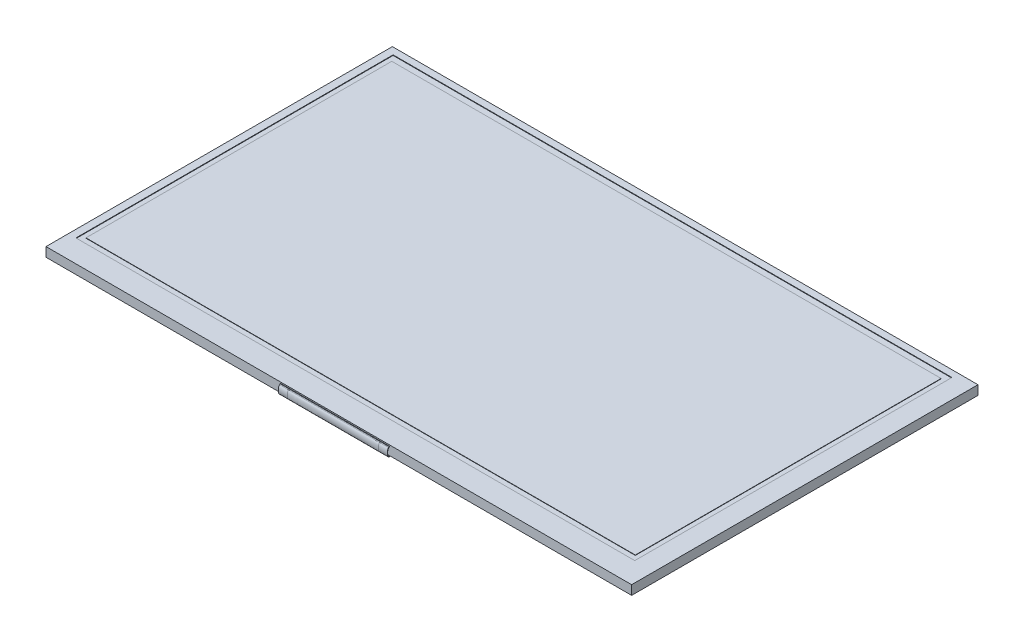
ISO-10303-21;
HEADER;
FILE_DESCRIPTION(('STEP AP214'),'2;1');
FILE_NAME('part.step','',(''),(''),'','','');
FILE_SCHEMA(('AUTOMOTIVE_DESIGN { 1 0 10303 214 1 1 1 1 }'));
ENDSEC;
DATA;
#1=APPLICATION_CONTEXT('core data for automotive mechanical design processes');
#2=APPLICATION_PROTOCOL_DEFINITION('international standard','automotive_design',2000,#1);
#3=PRODUCT_CONTEXT('',#1,'mechanical');
#4=PRODUCT('Part','Part','',(#3));
#5=PRODUCT_RELATED_PRODUCT_CATEGORY('part','',(#4));
#6=PRODUCT_DEFINITION_FORMATION('','',#4);
#7=PRODUCT_DEFINITION_CONTEXT('part definition',#1,'design');
#8=PRODUCT_DEFINITION('design','',#6,#7);
#9=PRODUCT_DEFINITION_SHAPE('','',#8);
#10=(LENGTH_UNIT() NAMED_UNIT(*) SI_UNIT(.MILLI.,.METRE.));
#11=(NAMED_UNIT(*) PLANE_ANGLE_UNIT() SI_UNIT($,.RADIAN.));
#12=(NAMED_UNIT(*) SI_UNIT($,.STERADIAN.) SOLID_ANGLE_UNIT());
#13=UNCERTAINTY_MEASURE_WITH_UNIT(LENGTH_MEASURE(1.E-05),#10,'distance_accuracy_value','');
#14=(GEOMETRIC_REPRESENTATION_CONTEXT(3) GLOBAL_UNCERTAINTY_ASSIGNED_CONTEXT((#13)) GLOBAL_UNIT_ASSIGNED_CONTEXT((#10,
#11,#12)) REPRESENTATION_CONTEXT('',''));
#15=CARTESIAN_POINT('',(0.,0.,0.));
#16=DIRECTION('',(0.,0.,1.));
#17=DIRECTION('',(1.,0.,0.));
#18=AXIS2_PLACEMENT_3D('',#15,#16,#17);
#19=CARTESIAN_POINT('',(76.92,-1.5,-42.816));
#20=DIRECTION('',(-1.,0.,0.));
#21=DIRECTION('',(0.,0.,1.));
#22=AXIS2_PLACEMENT_3D('',#19,#20,#21);
#23=PLANE('',#22);
#24=DIRECTION('',(0.,-1.,0.));
#25=VECTOR('',#24,1.);
#26=CARTESIAN_POINT('',(76.92,-1.55,42.816));
#27=LINE('',#26,#25);
#28=CARTESIAN_POINT('',(76.92,-1.55,42.816));
#29=VERTEX_POINT('',#28);
#30=CARTESIAN_POINT('',(76.92,-1.65,42.816));
#31=VERTEX_POINT('',#30);
#32=EDGE_CURVE('E142',#29,#31,#27,.T.);
#33=ORIENTED_EDGE('',*,*,#32,.T.);
#34=DIRECTION('',(0.,0.,1.));
#35=VECTOR('',#34,1.);
#36=CARTESIAN_POINT('',(76.92,-1.65,-42.816));
#37=LINE('',#36,#35);
#38=CARTESIAN_POINT('',(76.92,-1.65,-42.816));
#39=VERTEX_POINT('',#38);
#40=EDGE_CURVE('E212',#39,#31,#37,.T.);
#41=ORIENTED_EDGE('',*,*,#40,.F.);
#42=DIRECTION('',(0.,-1.,0.));
#43=VECTOR('',#42,1.);
#44=CARTESIAN_POINT('',(76.92,-1.55,-42.816));
#45=LINE('',#44,#43);
#46=CARTESIAN_POINT('',(76.92,-1.55,-42.816));
#47=VERTEX_POINT('',#46);
#48=EDGE_CURVE('E11',#47,#39,#45,.T.);
#49=ORIENTED_EDGE('',*,*,#48,.F.);
#50=DIRECTION('',(0.,0.,1.));
#51=VECTOR('',#50,1.);
#52=CARTESIAN_POINT('',(76.92,-1.55,-42.816));
#53=LINE('',#52,#51);
#54=EDGE_CURVE('E139',#47,#29,#53,.T.);
#55=ORIENTED_EDGE('',*,*,#54,.T.);
#56=EDGE_LOOP('',(#33,#41,#49,#55));
#57=FACE_BOUND('',#56,.T.);
#58=ADVANCED_FACE('F18',(#57),#23,.F.);
#59=CARTESIAN_POINT('',(-76.92,-1.5,-42.816));
#60=DIRECTION('',(0.,0.,1.));
#61=DIRECTION('',(1.,0.,0.));
#62=AXIS2_PLACEMENT_3D('',#59,#60,#61);
#63=PLANE('',#62);
#64=ORIENTED_EDGE('',*,*,#48,.T.);
#65=DIRECTION('',(1.,0.,0.));
#66=VECTOR('',#65,1.);
#67=CARTESIAN_POINT('',(-76.92,-1.65,-42.816));
#68=LINE('',#67,#66);
#69=CARTESIAN_POINT('',(-76.92,-1.65,-42.816));
#70=VERTEX_POINT('',#69);
#71=EDGE_CURVE('E209',#70,#39,#68,.T.);
#72=ORIENTED_EDGE('',*,*,#71,.F.);
#73=DIRECTION('',(0.,-1.,0.));
#74=VECTOR('',#73,1.);
#75=CARTESIAN_POINT('',(-76.92,-1.55,-42.816));
#76=LINE('',#75,#74);
#77=CARTESIAN_POINT('',(-76.92,-1.55,-42.816));
#78=VERTEX_POINT('',#77);
#79=EDGE_CURVE('E22',#78,#70,#76,.T.);
#80=ORIENTED_EDGE('',*,*,#79,.F.);
#81=DIRECTION('',(1.,0.,0.));
#82=VECTOR('',#81,1.);
#83=CARTESIAN_POINT('',(-76.92,-1.55,-42.816));
#84=LINE('',#83,#82);
#85=EDGE_CURVE('E145',#78,#47,#84,.T.);
#86=ORIENTED_EDGE('',*,*,#85,.T.);
#87=EDGE_LOOP('',(#64,#72,#80,#86));
#88=FACE_BOUND('',#87,.T.);
#89=ADVANCED_FACE('F831',(#88),#63,.F.);
#90=CARTESIAN_POINT('',(-76.92,-1.5,42.816));
#91=DIRECTION('',(1.,0.,0.));
#92=DIRECTION('',(0.,1.,0.));
#93=AXIS2_PLACEMENT_3D('',#90,#91,#92);
#94=PLANE('',#93);
#95=ORIENTED_EDGE('',*,*,#79,.T.);
#96=DIRECTION('',(0.,0.,-1.));
#97=VECTOR('',#96,1.);
#98=CARTESIAN_POINT('',(-76.92,-1.65,42.816));
#99=LINE('',#98,#97);
#100=CARTESIAN_POINT('',(-76.92,-1.65,42.816));
#101=VERTEX_POINT('',#100);
#102=EDGE_CURVE('E208',#101,#70,#99,.T.);
#103=ORIENTED_EDGE('',*,*,#102,.F.);
#104=DIRECTION('',(0.,-1.,0.));
#105=VECTOR('',#104,1.);
#106=CARTESIAN_POINT('',(-76.92,-1.55,42.816));
#107=LINE('',#106,#105);
#108=CARTESIAN_POINT('',(-76.92,-1.55,42.816));
#109=VERTEX_POINT('',#108);
#110=EDGE_CURVE('E159',#109,#101,#107,.T.);
#111=ORIENTED_EDGE('',*,*,#110,.F.);
#112=DIRECTION('',(0.,0.,1.));
#113=VECTOR('',#112,1.);
#114=CARTESIAN_POINT('',(-76.92,-1.55,-42.816));
#115=LINE('',#114,#113);
#116=EDGE_CURVE('E132',#78,#109,#115,.T.);
#117=ORIENTED_EDGE('',*,*,#116,.F.);
#118=EDGE_LOOP('',(#95,#103,#111,#117));
#119=FACE_BOUND('',#118,.T.);
#120=ADVANCED_FACE('F20',(#119),#94,.F.);
#121=CARTESIAN_POINT('',(0.,-1.55,0.));
#122=DIRECTION('',(0.,-1.,0.));
#123=DIRECTION('',(0.,0.,-1.));
#124=AXIS2_PLACEMENT_3D('',#121,#122,#123);
#125=PLANE('',#124);
#126=ORIENTED_EDGE('',*,*,#54,.F.);
#127=ORIENTED_EDGE('',*,*,#85,.F.);
#128=ORIENTED_EDGE('',*,*,#116,.T.);
#129=DIRECTION('',(1.,0.,0.));
#130=VECTOR('',#129,1.);
#131=CARTESIAN_POINT('',(-76.92,-1.55,42.816));
#132=LINE('',#131,#130);
#133=EDGE_CURVE('E146',#109,#29,#132,.T.);
#134=ORIENTED_EDGE('',*,*,#133,.T.);
#135=EDGE_LOOP('',(#126,#127,#128,#134));
#136=FACE_BOUND('',#135,.T.);
#137=ADVANCED_FACE('F148',(#136),#125,.F.);
#138=CARTESIAN_POINT('',(76.92,-1.5,42.816));
#139=DIRECTION('',(0.,0.,-1.));
#140=DIRECTION('',(0.,-1.,0.));
#141=AXIS2_PLACEMENT_3D('',#138,#139,#140);
#142=PLANE('',#141);
#143=ORIENTED_EDGE('',*,*,#110,.T.);
#144=DIRECTION('',(-1.,0.,0.));
#145=VECTOR('',#144,1.);
#146=CARTESIAN_POINT('',(76.92,-1.65,42.816));
#147=LINE('',#146,#145);
#148=EDGE_CURVE('E156',#31,#101,#147,.T.);
#149=ORIENTED_EDGE('',*,*,#148,.F.);
#150=ORIENTED_EDGE('',*,*,#32,.F.);
#151=ORIENTED_EDGE('',*,*,#133,.F.);
#152=EDGE_LOOP('',(#143,#149,#150,#151));
#153=FACE_BOUND('',#152,.T.);
#154=ADVANCED_FACE('F154',(#153),#142,.F.);
#155=CARTESIAN_POINT('',(0.,-1.65,0.));
#156=DIRECTION('',(0.,1.,0.));
#157=DIRECTION('',(1.,0.,0.));
#158=AXIS2_PLACEMENT_3D('',#155,#156,#157);
#159=PLANE('',#158);
#160=ORIENTED_EDGE('',*,*,#102,.T.);
#161=ORIENTED_EDGE('',*,*,#71,.T.);
#162=ORIENTED_EDGE('',*,*,#40,.T.);
#163=ORIENTED_EDGE('',*,*,#148,.T.);
#164=EDGE_LOOP('',(#160,#161,#162,#163));
#165=FACE_BOUND('',#164,.T.);
#166=DIRECTION('',(-1.,0.,0.));
#167=VECTOR('',#166,1.);
#168=CARTESIAN_POINT('',(78.25,-1.65,-44.516));
#169=LINE('',#168,#167);
#170=CARTESIAN_POINT('',(78.25,-1.65,-44.516));
#171=VERTEX_POINT('',#170);
#172=CARTESIAN_POINT('',(-78.25,-1.65,-44.516));
#173=VERTEX_POINT('',#172);
#174=EDGE_CURVE('E187',#171,#173,#169,.T.);
#175=ORIENTED_EDGE('',*,*,#174,.T.);
#176=DIRECTION('',(0.,0.,1.));
#177=VECTOR('',#176,1.);
#178=CARTESIAN_POINT('',(-78.25,-1.65,-44.516));
#179=LINE('',#178,#177);
#180=CARTESIAN_POINT('',(-78.25,-1.65,44.304));
#181=VERTEX_POINT('',#180);
#182=EDGE_CURVE('E188',#173,#181,#179,.T.);
#183=ORIENTED_EDGE('',*,*,#182,.T.);
#184=DIRECTION('',(1.,0.,0.));
#185=VECTOR('',#184,1.);
#186=CARTESIAN_POINT('',(-78.25,-1.65,44.304));
#187=LINE('',#186,#185);
#188=CARTESIAN_POINT('',(78.25,-1.65,44.304));
#189=VERTEX_POINT('',#188);
#190=EDGE_CURVE('E199',#181,#189,#187,.T.);
#191=ORIENTED_EDGE('',*,*,#190,.T.);
#192=DIRECTION('',(0.,0.,-1.));
#193=VECTOR('',#192,1.);
#194=CARTESIAN_POINT('',(78.25,-1.65,44.304));
#195=LINE('',#194,#193);
#196=EDGE_CURVE('E193',#189,#171,#195,.T.);
#197=ORIENTED_EDGE('',*,*,#196,.T.);
#198=EDGE_LOOP('',(#175,#183,#191,#197));
#199=FACE_BOUND('',#198,.T.);
#200=ADVANCED_FACE('F1020',(#165,#199),#159,.T.);
#201=CARTESIAN_POINT('',(78.25,-1.5,-44.516));
#202=DIRECTION('',(0.,0.,-1.));
#203=DIRECTION('',(0.,-1.,0.));
#204=AXIS2_PLACEMENT_3D('',#201,#202,#203);
#205=PLANE('',#204);
#206=DIRECTION('',(0.,-1.,0.));
#207=VECTOR('',#206,1.);
#208=CARTESIAN_POINT('',(-78.25,-1.5,-44.516));
#209=LINE('',#208,#207);
#210=CARTESIAN_POINT('',(-78.25,-1.5,-44.516));
#211=VERTEX_POINT('',#210);
#212=EDGE_CURVE('E183',#211,#173,#209,.T.);
#213=ORIENTED_EDGE('',*,*,#212,.T.);
#214=ORIENTED_EDGE('',*,*,#174,.F.);
#215=DIRECTION('',(0.,-1.,0.));
#216=VECTOR('',#215,1.);
#217=CARTESIAN_POINT('',(78.25,-1.5,-44.516));
#218=LINE('',#217,#216);
#219=CARTESIAN_POINT('',(78.25,-1.5,-44.516));
#220=VERTEX_POINT('',#219);
#221=EDGE_CURVE('E189',#220,#171,#218,.T.);
#222=ORIENTED_EDGE('',*,*,#221,.F.);
#223=DIRECTION('',(-1.,0.,0.));
#224=VECTOR('',#223,1.);
#225=CARTESIAN_POINT('',(78.25,-1.5,-44.516));
#226=LINE('',#225,#224);
#227=EDGE_CURVE('E412',#220,#211,#226,.T.);
#228=ORIENTED_EDGE('',*,*,#227,.T.);
#229=EDGE_LOOP('',(#213,#214,#222,#228));
#230=FACE_BOUND('',#229,.T.);
#231=ADVANCED_FACE('F1162',(#230),#205,.F.);
#232=CARTESIAN_POINT('',(-78.25,-1.5,-44.516));
#233=DIRECTION('',(-1.,0.,0.));
#234=DIRECTION('',(0.,0.,1.));
#235=AXIS2_PLACEMENT_3D('',#232,#233,#234);
#236=PLANE('',#235);
#237=DIRECTION('',(0.,-1.,0.));
#238=VECTOR('',#237,1.);
#239=CARTESIAN_POINT('',(-78.25,-1.5,44.304));
#240=LINE('',#239,#238);
#241=CARTESIAN_POINT('',(-78.25,-1.5,44.304));
#242=VERTEX_POINT('',#241);
#243=EDGE_CURVE('E203',#242,#181,#240,.T.);
#244=ORIENTED_EDGE('',*,*,#243,.T.);
#245=ORIENTED_EDGE('',*,*,#182,.F.);
#246=ORIENTED_EDGE('',*,*,#212,.F.);
#247=DIRECTION('',(0.,0.,1.));
#248=VECTOR('',#247,1.);
#249=CARTESIAN_POINT('',(-78.25,-1.5,-44.516));
#250=LINE('',#249,#248);
#251=EDGE_CURVE('E362',#211,#242,#250,.T.);
#252=ORIENTED_EDGE('',*,*,#251,.T.);
#253=EDGE_LOOP('',(#244,#245,#246,#252));
#254=FACE_BOUND('',#253,.T.);
#255=ADVANCED_FACE('F1153',(#254),#236,.F.);
#256=CARTESIAN_POINT('',(-78.25,-1.5,44.304));
#257=DIRECTION('',(0.,0.,1.));
#258=DIRECTION('',(1.,0.,0.));
#259=AXIS2_PLACEMENT_3D('',#256,#257,#258);
#260=PLANE('',#259);
#261=DIRECTION('',(0.,-1.,0.));
#262=VECTOR('',#261,1.);
#263=CARTESIAN_POINT('',(78.25,-1.5,44.304));
#264=LINE('',#263,#262);
#265=CARTESIAN_POINT('',(78.25,-1.5,44.304));
#266=VERTEX_POINT('',#265);
#267=EDGE_CURVE('E198',#266,#189,#264,.T.);
#268=ORIENTED_EDGE('',*,*,#267,.T.);
#269=ORIENTED_EDGE('',*,*,#190,.F.);
#270=ORIENTED_EDGE('',*,*,#243,.F.);
#271=DIRECTION('',(1.,0.,0.));
#272=VECTOR('',#271,1.);
#273=CARTESIAN_POINT('',(-78.25,-1.5,44.304));
#274=LINE('',#273,#272);
#275=EDGE_CURVE('E428',#242,#266,#274,.T.);
#276=ORIENTED_EDGE('',*,*,#275,.T.);
#277=EDGE_LOOP('',(#268,#269,#270,#276));
#278=FACE_BOUND('',#277,.T.);
#279=ADVANCED_FACE('F1144',(#278),#260,.F.);
#280=CARTESIAN_POINT('',(78.25,-1.5,44.304));
#281=DIRECTION('',(1.,0.,0.));
#282=DIRECTION('',(0.,1.,0.));
#283=AXIS2_PLACEMENT_3D('',#280,#281,#282);
#284=PLANE('',#283);
#285=ORIENTED_EDGE('',*,*,#221,.T.);
#286=ORIENTED_EDGE('',*,*,#196,.F.);
#287=ORIENTED_EDGE('',*,*,#267,.F.);
#288=DIRECTION('',(0.,0.,-1.));
#289=VECTOR('',#288,1.);
#290=CARTESIAN_POINT('',(78.25,-1.5,44.304));
#291=LINE('',#290,#289);
#292=EDGE_CURVE('E407',#266,#220,#291,.T.);
#293=ORIENTED_EDGE('',*,*,#292,.T.);
#294=EDGE_LOOP('',(#285,#286,#287,#293));
#295=FACE_BOUND('',#294,.T.);
#296=ADVANCED_FACE('F1134',(#295),#284,.F.);
#297=CARTESIAN_POINT('',(-25.,-1.85,132.1733474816));
#298=DIRECTION('',(0.,-1.,0.));
#299=DIRECTION('',(0.,0.,-1.));
#300=AXIS2_PLACEMENT_3D('',#297,#298,#299);
#301=PLANE('',#300);
#302=DIRECTION('',(0.,0.,-1.));
#303=VECTOR('',#302,1.);
#304=CARTESIAN_POINT('',(15.85,-1.85,50.72832834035));
#305=LINE('',#304,#303);
#306=CARTESIAN_POINT('',(15.85,-1.85,50.72832834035));
#307=VERTEX_POINT('',#306);
#308=CARTESIAN_POINT('',(15.85,-1.85,50.584));
#309=VERTEX_POINT('',#308);
#310=EDGE_CURVE('E177',#307,#309,#305,.T.);
#311=ORIENTED_EDGE('',*,*,#310,.T.);
#312=DIRECTION('',(1.,0.,0.));
#313=VECTOR('',#312,1.);
#314=CARTESIAN_POINT('',(-14.65,-1.85,50.584));
#315=LINE('',#314,#313);
#316=CARTESIAN_POINT('',(-14.65,-1.85,50.584));
#317=VERTEX_POINT('',#316);
#318=EDGE_CURVE('E442',#317,#309,#315,.T.);
#319=ORIENTED_EDGE('',*,*,#318,.F.);
#320=DIRECTION('',(0.,0.,1.));
#321=VECTOR('',#320,1.);
#322=CARTESIAN_POINT('',(-14.65,-1.85,50.584));
#323=LINE('',#322,#321);
#324=CARTESIAN_POINT('',(-14.65,-1.85,50.72832834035));
#325=VERTEX_POINT('',#324);
#326=EDGE_CURVE('E401',#317,#325,#323,.T.);
#327=ORIENTED_EDGE('',*,*,#326,.T.);
#328=DIRECTION('',(1.,0.,0.));
#329=VECTOR('',#328,1.);
#330=CARTESIAN_POINT('',(-14.65,-1.85,50.72832834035));
#331=LINE('',#330,#329);
#332=EDGE_CURVE('E194',#325,#307,#331,.T.);
#333=ORIENTED_EDGE('',*,*,#332,.T.);
#334=EDGE_LOOP('',(#311,#319,#327,#333));
#335=FACE_BOUND('',#334,.T.);
#336=ADVANCED_FACE('F1125',(#335),#301,.F.);
#337=CARTESIAN_POINT('',(15.85,-2.,50.88496090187));
#338=DIRECTION('',(0.,-0.722232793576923,-0.691650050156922));
#339=DIRECTION('',(0.,0.691650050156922,-0.722232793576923));
#340=AXIS2_PLACEMENT_3D('',#337,#338,#339);
#341=PLANE('',#340);
#342=DIRECTION('',(0.,0.691650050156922,-0.722232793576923));
#343=VECTOR('',#342,1.);
#344=CARTESIAN_POINT('',(15.85,-2.,50.88496090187));
#345=LINE('',#344,#343);
#346=CARTESIAN_POINT('',(15.85,-2.,50.88496090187));
#347=VERTEX_POINT('',#346);
#348=EDGE_CURVE('E182',#347,#307,#345,.T.);
#349=ORIENTED_EDGE('',*,*,#348,.T.);
#350=ORIENTED_EDGE('',*,*,#332,.F.);
#351=DIRECTION('',(0.,0.691650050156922,-0.722232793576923));
#352=VECTOR('',#351,1.);
#353=CARTESIAN_POINT('',(-14.65,-2.,50.88496090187));
#354=LINE('',#353,#352);
#355=CARTESIAN_POINT('',(-14.65,-2.,50.88496090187));
#356=VERTEX_POINT('',#355);
#357=EDGE_CURVE('E406',#356,#325,#354,.T.);
#358=ORIENTED_EDGE('',*,*,#357,.F.);
#359=DIRECTION('',(-1.,0.,0.));
#360=VECTOR('',#359,1.);
#361=CARTESIAN_POINT('',(-12.15,-2.,50.88496090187));
#362=LINE('',#361,#360);
#363=CARTESIAN_POINT('',(-12.15,-2.,50.88496090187));
#364=VERTEX_POINT('',#363);
#365=EDGE_CURVE('E552',#364,#356,#362,.T.);
#366=ORIENTED_EDGE('',*,*,#365,.F.);
#367=DIRECTION('',(-1.,0.,0.));
#368=VECTOR('',#367,1.);
#369=CARTESIAN_POINT('',(13.35,-2.,50.88496090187));
#370=LINE('',#369,#368);
#371=CARTESIAN_POINT('',(13.35,-2.,50.88496090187));
#372=VERTEX_POINT('',#371);
#373=EDGE_CURVE('E569',#372,#364,#370,.T.);
#374=ORIENTED_EDGE('',*,*,#373,.F.);
#375=DIRECTION('',(-1.,0.,0.));
#376=VECTOR('',#375,1.);
#377=CARTESIAN_POINT('',(15.85,-2.,50.88496090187));
#378=LINE('',#377,#376);
#379=EDGE_CURVE('E388',#347,#372,#378,.T.);
#380=ORIENTED_EDGE('',*,*,#379,.F.);
#381=EDGE_LOOP('',(#349,#350,#358,#366,#374,#380));
#382=FACE_BOUND('',#381,.T.);
#383=ADVANCED_FACE('F1116',(#382),#341,.F.);
#384=CARTESIAN_POINT('',(15.85,-1.5,72.91915813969));
#385=DIRECTION('',(1.,0.,0.));
#386=DIRECTION('',(0.,1.,0.));
#387=AXIS2_PLACEMENT_3D('',#384,#385,#386);
#388=PLANE('',#387);
#389=DIRECTION('',(0.,0.,-1.));
#390=VECTOR('',#389,1.);
#391=CARTESIAN_POINT('',(15.85,-4.35,50.56529014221));
#392=LINE('',#391,#390);
#393=CARTESIAN_POINT('',(15.85,-4.35,50.56529014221));
#394=VERTEX_POINT('',#393);
#395=CARTESIAN_POINT('',(15.85,-4.35,24.64849660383));
#396=VERTEX_POINT('',#395);
#397=EDGE_CURVE('E602',#394,#396,#392,.T.);
#398=ORIENTED_EDGE('',*,*,#397,.T.);
#399=DIRECTION('',(0.,1.,0.));
#400=VECTOR('',#399,1.);
#401=CARTESIAN_POINT('',(15.85,-4.35,24.64849660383));
#402=LINE('',#401,#400);
#403=CARTESIAN_POINT('',(15.85,-4.2,24.64849660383));
#404=VERTEX_POINT('',#403);
#405=EDGE_CURVE('E337',#396,#404,#402,.T.);
#406=ORIENTED_EDGE('',*,*,#405,.T.);
#407=DIRECTION('',(0.,0.,1.));
#408=VECTOR('',#407,1.);
#409=CARTESIAN_POINT('',(15.85,-4.2,24.64849660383));
#410=LINE('',#409,#408);
#411=CARTESIAN_POINT('',(15.85,-4.2,50.64849660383));
#412=VERTEX_POINT('',#411);
#413=EDGE_CURVE('E349',#404,#412,#410,.T.);
#414=ORIENTED_EDGE('',*,*,#413,.T.);
#415=CARTESIAN_POINT('',(15.85,-4.2,50.64849660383));
#416=CARTESIAN_POINT('',(15.85,-4.2,50.71350400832));
#417=CARTESIAN_POINT('',(15.85,-4.157132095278,50.90230410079));
#418=CARTESIAN_POINT('',(15.85,-3.872381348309,51.05444778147));
#419=CARTESIAN_POINT('',(15.85,-3.469567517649,51.12424216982));
#420=CARTESIAN_POINT('',(15.85,-3.017180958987,51.11451331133));
#421=CARTESIAN_POINT('',(15.85,-2.556318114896,51.05956240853));
#422=CARTESIAN_POINT('',(15.85,-2.17077008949,50.90843423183));
#423=CARTESIAN_POINT('',(15.85,-2.027815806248,50.69884456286));
#424=CARTESIAN_POINT('',(15.85,-2.,50.584));
#425=(BOUNDED_CURVE() B_SPLINE_CURVE(3,(#415,#416,#417,#418,#419,#420,#421,#422,#423,#424),
.UNSPECIFIED.,.F.,.F.) B_SPLINE_CURVE_WITH_KNOTS((4,1,1,1,1,1,1,4),(0.,0.07915888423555,
0.1978417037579,0.3417584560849,0.5513823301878,0.7106827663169,0.8781796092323,1.),
.UNSPECIFIED.) CURVE() GEOMETRIC_REPRESENTATION_ITEM() RATIONAL_B_SPLINE_CURVE((1.,1.,1.,1.,1.,
1.,1.,1.,1.,1.)) REPRESENTATION_ITEM(''));
#426=CARTESIAN_POINT('',(15.85,-2.,50.584));
#427=VERTEX_POINT('',#426);
#428=EDGE_CURVE('E495',#412,#427,#425,.T.);
#429=ORIENTED_EDGE('',*,*,#428,.T.);
#430=DIRECTION('',(0.,-1.,0.));
#431=VECTOR('',#430,1.);
#432=CARTESIAN_POINT('',(15.85,-1.85,50.584));
#433=LINE('',#432,#431);
#434=EDGE_CURVE('E443',#309,#427,#433,.T.);
#435=ORIENTED_EDGE('',*,*,#434,.F.);
#436=ORIENTED_EDGE('',*,*,#310,.F.);
#437=ORIENTED_EDGE('',*,*,#348,.F.);
#438=CARTESIAN_POINT('',(15.85,-2.,50.88496090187));
#439=CARTESIAN_POINT('',(15.85,-2.002040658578,50.88709179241));
#440=CARTESIAN_POINT('',(15.85,-2.154162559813,51.04367145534));
#441=CARTESIAN_POINT('',(15.85,-2.564662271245,51.1813065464));
#442=CARTESIAN_POINT('',(15.85,-3.110304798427,51.22021048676));
#443=CARTESIAN_POINT('',(15.85,-3.573341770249,51.21609924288));
#444=CARTESIAN_POINT('',(15.85,-3.98416393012,51.14055048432));
#445=CARTESIAN_POINT('',(15.85,-4.259710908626,50.96305634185));
#446=CARTESIAN_POINT('',(15.85,-4.347463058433,50.73755411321));
#447=CARTESIAN_POINT('',(15.85,-4.35,50.62339225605));
#448=CARTESIAN_POINT('',(15.85,-4.35,50.56529014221));
#449=(BOUNDED_CURVE() B_SPLINE_CURVE(3,(#438,#439,#440,#441,#442,#443,#444,#445,#446,#447,#448),
.UNSPECIFIED.,.F.,.F.) B_SPLINE_CURVE_WITH_KNOTS((4,1,1,1,1,1,1,1,4),(0.,0.003310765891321,
0.2449257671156,0.4256543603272,0.6071027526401,0.7429683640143,0.8796419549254,0.9351545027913,
1.),.UNSPECIFIED.) CURVE() GEOMETRIC_REPRESENTATION_ITEM() RATIONAL_B_SPLINE_CURVE((1.,1.,1.,1.,
1.,1.,1.,1.,1.,1.,1.)) REPRESENTATION_ITEM(''));
#450=EDGE_CURVE('E382',#347,#394,#449,.T.);
#451=ORIENTED_EDGE('',*,*,#450,.T.);
#452=EDGE_LOOP('',(#398,#406,#414,#429,#435,#436,#437,#451));
#453=FACE_BOUND('',#452,.T.);
#454=ADVANCED_FACE('F1106',(#453),#388,.T.);
#455=CARTESIAN_POINT('',(13.35,-4.8,4.184));
#456=DIRECTION('',(1.,0.,0.));
#457=DIRECTION('',(0.,0.,1.));
#458=AXIS2_PLACEMENT_3D('',#455,#456,#457);
#459=CYLINDRICAL_SURFACE('',#458,0.45);
#460=DIRECTION('',(-1.,0.,0.));
#461=VECTOR('',#460,1.);
#462=CARTESIAN_POINT('',(13.35,-4.35,4.184));
#463=LINE('',#462,#461);
#464=CARTESIAN_POINT('',(13.35,-4.35,4.184));
#465=VERTEX_POINT('',#464);
#466=CARTESIAN_POINT('',(-12.15,-4.35,4.184));
#467=VERTEX_POINT('',#466);
#468=EDGE_CURVE('E587',#465,#467,#463,.T.);
#469=ORIENTED_EDGE('',*,*,#468,.T.);
#470=CARTESIAN_POINT('',(-12.15,-4.8,4.184));
#471=DIRECTION('',(-1.,0.,0.));
#472=DIRECTION('',(0.,1.,0.));
#473=AXIS2_PLACEMENT_3D('',#470,#471,#472);
#474=CIRCLE('',#473,0.45);
#475=CARTESIAN_POINT('',(-12.15,-4.8,3.734));
#476=VERTEX_POINT('',#475);
#477=EDGE_CURVE('E326',#467,#476,#474,.T.);
#478=ORIENTED_EDGE('',*,*,#477,.T.);
#479=DIRECTION('',(-1.,0.,0.));
#480=VECTOR('',#479,1.);
#481=CARTESIAN_POINT('',(13.35,-4.8,3.734));
#482=LINE('',#481,#480);
#483=CARTESIAN_POINT('',(13.35,-4.8,3.734));
#484=VERTEX_POINT('',#483);
#485=EDGE_CURVE('E174',#484,#476,#482,.T.);
#486=ORIENTED_EDGE('',*,*,#485,.F.);
#487=CARTESIAN_POINT('',(13.35,-4.8,4.184));
#488=DIRECTION('',(-1.,0.,0.));
#489=DIRECTION('',(0.,1.,0.));
#490=AXIS2_PLACEMENT_3D('',#487,#488,#489);
#491=CIRCLE('',#490,0.45);
#492=EDGE_CURVE('E227',#465,#484,#491,.T.);
#493=ORIENTED_EDGE('',*,*,#492,.F.);
#494=EDGE_LOOP('',(#469,#478,#486,#493));
#495=FACE_BOUND('',#494,.T.);
#496=ADVANCED_FACE('F1096',(#495),#459,.F.);
#497=CARTESIAN_POINT('',(13.35,-4.8,3.734));
#498=DIRECTION('',(0.,0.,1.));
#499=DIRECTION('',(1.,0.,0.));
#500=AXIS2_PLACEMENT_3D('',#497,#498,#499);
#501=PLANE('',#500);
#502=ORIENTED_EDGE('',*,*,#485,.T.);
#503=DIRECTION('',(0.,-1.,0.));
#504=VECTOR('',#503,1.);
#505=CARTESIAN_POINT('',(-12.15,-4.8,3.734));
#506=LINE('',#505,#504);
#507=CARTESIAN_POINT('',(-12.15,-7.75,3.734));
#508=VERTEX_POINT('',#507);
#509=EDGE_CURVE('E318',#476,#508,#506,.T.);
#510=ORIENTED_EDGE('',*,*,#509,.T.);
#511=DIRECTION('',(-1.,0.,0.));
#512=VECTOR('',#511,1.);
#513=CARTESIAN_POINT('',(13.35,-7.75,3.734));
#514=LINE('',#513,#512);
#515=CARTESIAN_POINT('',(13.35,-7.75,3.734));
#516=VERTEX_POINT('',#515);
#517=EDGE_CURVE('E178',#516,#508,#514,.T.);
#518=ORIENTED_EDGE('',*,*,#517,.F.);
#519=DIRECTION('',(0.,-1.,0.));
#520=VECTOR('',#519,1.);
#521=CARTESIAN_POINT('',(13.35,-4.8,3.734));
#522=LINE('',#521,#520);
#523=EDGE_CURVE('E230',#484,#516,#522,.T.);
#524=ORIENTED_EDGE('',*,*,#523,.F.);
#525=EDGE_LOOP('',(#502,#510,#518,#524));
#526=FACE_BOUND('',#525,.T.);
#527=ADVANCED_FACE('F1086',(#526),#501,.T.);
#528=CARTESIAN_POINT('',(13.35,-7.75,3.134));
#529=DIRECTION('',(1.,0.,0.));
#530=DIRECTION('',(0.,0.,1.));
#531=AXIS2_PLACEMENT_3D('',#528,#529,#530);
#532=CYLINDRICAL_SURFACE('',#531,0.6);
#533=ORIENTED_EDGE('',*,*,#517,.T.);
#534=CARTESIAN_POINT('',(-12.15,-7.75,3.134));
#535=DIRECTION('',(1.,0.,0.));
#536=DIRECTION('',(0.,0.,1.));
#537=AXIS2_PLACEMENT_3D('',#534,#535,#536);
#538=CIRCLE('',#537,0.6);
#539=CARTESIAN_POINT('',(-12.15,-8.35,3.134));
#540=VERTEX_POINT('',#539);
#541=EDGE_CURVE('E314',#508,#540,#538,.T.);
#542=ORIENTED_EDGE('',*,*,#541,.T.);
#543=DIRECTION('',(-1.,0.,0.));
#544=VECTOR('',#543,1.);
#545=CARTESIAN_POINT('',(13.35,-8.35,3.134));
#546=LINE('',#545,#544);
#547=CARTESIAN_POINT('',(13.35,-8.35,3.134));
#548=VERTEX_POINT('',#547);
#549=EDGE_CURVE('E172',#548,#540,#546,.T.);
#550=ORIENTED_EDGE('',*,*,#549,.F.);
#551=CARTESIAN_POINT('',(13.35,-7.75,3.134));
#552=DIRECTION('',(1.,0.,0.));
#553=DIRECTION('',(0.,0.,1.));
#554=AXIS2_PLACEMENT_3D('',#551,#552,#553);
#555=CIRCLE('',#554,0.6);
#556=EDGE_CURVE('E234',#516,#548,#555,.T.);
#557=ORIENTED_EDGE('',*,*,#556,.F.);
#558=EDGE_LOOP('',(#533,#542,#550,#557));
#559=FACE_BOUND('',#558,.T.);
#560=ADVANCED_FACE('F1076',(#559),#532,.T.);
#561=CARTESIAN_POINT('',(13.35,-8.35,3.134));
#562=DIRECTION('',(0.,-1.,0.));
#563=DIRECTION('',(0.,0.,-1.));
#564=AXIS2_PLACEMENT_3D('',#561,#562,#563);
#565=PLANE('',#564);
#566=ORIENTED_EDGE('',*,*,#549,.T.);
#567=DIRECTION('',(0.,0.,-1.));
#568=VECTOR('',#567,1.);
#569=CARTESIAN_POINT('',(-12.15,-8.35,3.134));
#570=LINE('',#569,#568);
#571=CARTESIAN_POINT('',(-12.15,-8.35,-10.416));
#572=VERTEX_POINT('',#571);
#573=EDGE_CURVE('E294',#540,#572,#570,.T.);
#574=ORIENTED_EDGE('',*,*,#573,.T.);
#575=DIRECTION('',(-1.,0.,0.));
#576=VECTOR('',#575,1.);
#577=CARTESIAN_POINT('',(13.35,-8.35,-10.416));
#578=LINE('',#577,#576);
#579=CARTESIAN_POINT('',(13.35,-8.35,-10.416));
#580=VERTEX_POINT('',#579);
#581=EDGE_CURVE('E169',#580,#572,#578,.T.);
#582=ORIENTED_EDGE('',*,*,#581,.F.);
#583=DIRECTION('',(0.,0.,-1.));
#584=VECTOR('',#583,1.);
#585=CARTESIAN_POINT('',(13.35,-8.35,3.134));
#586=LINE('',#585,#584);
#587=EDGE_CURVE('E238',#548,#580,#586,.T.);
#588=ORIENTED_EDGE('',*,*,#587,.F.);
#589=EDGE_LOOP('',(#566,#574,#582,#588));
#590=FACE_BOUND('',#589,.T.);
#591=ADVANCED_FACE('F1068',(#590),#565,.T.);
#592=CARTESIAN_POINT('',(13.35,-8.35,-10.416));
#593=DIRECTION('',(0.,0.,-1.));
#594=DIRECTION('',(0.,-1.,0.));
#595=AXIS2_PLACEMENT_3D('',#592,#593,#594);
#596=PLANE('',#595);
#597=ORIENTED_EDGE('',*,*,#581,.T.);
#598=DIRECTION('',(0.,1.,0.));
#599=VECTOR('',#598,1.);
#600=CARTESIAN_POINT('',(-12.15,-8.35,-10.416));
#601=LINE('',#600,#599);
#602=CARTESIAN_POINT('',(-12.15,-8.2,-10.416));
#603=VERTEX_POINT('',#602);
#604=EDGE_CURVE('E288',#572,#603,#601,.T.);
#605=ORIENTED_EDGE('',*,*,#604,.T.);
#606=DIRECTION('',(-1.,0.,0.));
#607=VECTOR('',#606,1.);
#608=CARTESIAN_POINT('',(13.35,-8.2,-10.416));
#609=LINE('',#608,#607);
#610=CARTESIAN_POINT('',(13.35,-8.2,-10.416));
#611=VERTEX_POINT('',#610);
#612=EDGE_CURVE('E173',#611,#603,#609,.T.);
#613=ORIENTED_EDGE('',*,*,#612,.F.);
#614=DIRECTION('',(0.,1.,0.));
#615=VECTOR('',#614,1.);
#616=CARTESIAN_POINT('',(13.35,-8.35,-10.416));
#617=LINE('',#616,#615);
#618=EDGE_CURVE('E244',#580,#611,#617,.T.);
#619=ORIENTED_EDGE('',*,*,#618,.F.);
#620=EDGE_LOOP('',(#597,#605,#613,#619));
#621=FACE_BOUND('',#620,.T.);
#622=ADVANCED_FACE('F289',(#621),#596,.T.);
#623=CARTESIAN_POINT('',(13.35,-8.2,-10.416));
#624=DIRECTION('',(0.,1.,0.));
#625=DIRECTION('',(1.,0.,0.));
#626=AXIS2_PLACEMENT_3D('',#623,#624,#625);
#627=PLANE('',#626);
#628=ORIENTED_EDGE('',*,*,#612,.T.);
#629=DIRECTION('',(0.,0.,1.));
#630=VECTOR('',#629,1.);
#631=CARTESIAN_POINT('',(-12.15,-8.2,-10.416));
#632=LINE('',#631,#630);
#633=CARTESIAN_POINT('',(-12.15,-8.2,3.134));
#634=VERTEX_POINT('',#633);
#635=EDGE_CURVE('E278',#603,#634,#632,.T.);
#636=ORIENTED_EDGE('',*,*,#635,.T.);
#637=DIRECTION('',(-1.,0.,0.));
#638=VECTOR('',#637,1.);
#639=CARTESIAN_POINT('',(13.35,-8.2,3.134));
#640=LINE('',#639,#638);
#641=CARTESIAN_POINT('',(13.35,-8.2,3.134));
#642=VERTEX_POINT('',#641);
#643=EDGE_CURVE('E263',#642,#634,#640,.T.);
#644=ORIENTED_EDGE('',*,*,#643,.F.);
#645=DIRECTION('',(0.,0.,1.));
#646=VECTOR('',#645,1.);
#647=CARTESIAN_POINT('',(13.35,-8.2,-10.416));
#648=LINE('',#647,#646);
#649=EDGE_CURVE('E253',#611,#642,#648,.T.);
#650=ORIENTED_EDGE('',*,*,#649,.F.);
#651=EDGE_LOOP('',(#628,#636,#644,#650));
#652=FACE_BOUND('',#651,.T.);
#653=ADVANCED_FACE('F275',(#652),#627,.T.);
#654=CARTESIAN_POINT('',(13.35,-7.75,3.134));
#655=DIRECTION('',(1.,0.,0.));
#656=DIRECTION('',(0.,0.,1.));
#657=AXIS2_PLACEMENT_3D('',#654,#655,#656);
#658=CYLINDRICAL_SURFACE('',#657,0.45);
#659=ORIENTED_EDGE('',*,*,#643,.T.);
#660=CARTESIAN_POINT('',(-12.15,-7.75,3.134));
#661=DIRECTION('',(-1.,0.,0.));
#662=DIRECTION('',(0.,-1.,0.));
#663=AXIS2_PLACEMENT_3D('',#660,#661,#662);
#664=CIRCLE('',#663,0.45);
#665=CARTESIAN_POINT('',(-12.15,-7.75,3.584));
#666=VERTEX_POINT('',#665);
#667=EDGE_CURVE('E300',#634,#666,#664,.T.);
#668=ORIENTED_EDGE('',*,*,#667,.T.);
#669=DIRECTION('',(-1.,0.,0.));
#670=VECTOR('',#669,1.);
#671=CARTESIAN_POINT('',(13.35,-7.75,3.584));
#672=LINE('',#671,#670);
#673=CARTESIAN_POINT('',(13.35,-7.75,3.584));
#674=VERTEX_POINT('',#673);
#675=EDGE_CURVE('E261',#674,#666,#672,.T.);
#676=ORIENTED_EDGE('',*,*,#675,.F.);
#677=CARTESIAN_POINT('',(13.35,-7.75,3.134));
#678=DIRECTION('',(-1.,0.,0.));
#679=DIRECTION('',(0.,-1.,0.));
#680=AXIS2_PLACEMENT_3D('',#677,#678,#679);
#681=CIRCLE('',#680,0.45);
#682=EDGE_CURVE('E248',#642,#674,#681,.T.);
#683=ORIENTED_EDGE('',*,*,#682,.F.);
#684=EDGE_LOOP('',(#659,#668,#676,#683));
#685=FACE_BOUND('',#684,.T.);
#686=ADVANCED_FACE('F626',(#685),#658,.F.);
#687=CARTESIAN_POINT('',(13.35,-7.75,3.584));
#688=DIRECTION('',(0.,0.,-1.));
#689=DIRECTION('',(0.,-1.,0.));
#690=AXIS2_PLACEMENT_3D('',#687,#688,#689);
#691=PLANE('',#690);
#692=ORIENTED_EDGE('',*,*,#675,.T.);
#693=DIRECTION('',(0.,1.,0.));
#694=VECTOR('',#693,1.);
#695=CARTESIAN_POINT('',(-12.15,-7.75,3.584));
#696=LINE('',#695,#694);
#697=CARTESIAN_POINT('',(-12.15,-4.8,3.584));
#698=VERTEX_POINT('',#697);
#699=EDGE_CURVE('E307',#666,#698,#696,.T.);
#700=ORIENTED_EDGE('',*,*,#699,.T.);
#701=DIRECTION('',(-1.,0.,0.));
#702=VECTOR('',#701,1.);
#703=CARTESIAN_POINT('',(13.35,-4.8,3.584));
#704=LINE('',#703,#702);
#705=CARTESIAN_POINT('',(13.35,-4.8,3.584));
#706=VERTEX_POINT('',#705);
#707=EDGE_CURVE('E257',#706,#698,#704,.T.);
#708=ORIENTED_EDGE('',*,*,#707,.F.);
#709=DIRECTION('',(0.,1.,0.));
#710=VECTOR('',#709,1.);
#711=CARTESIAN_POINT('',(13.35,-7.75,3.584));
#712=LINE('',#711,#710);
#713=EDGE_CURVE('E252',#674,#706,#712,.T.);
#714=ORIENTED_EDGE('',*,*,#713,.F.);
#715=EDGE_LOOP('',(#692,#700,#708,#714));
#716=FACE_BOUND('',#715,.T.);
#717=ADVANCED_FACE('F619',(#716),#691,.T.);
#718=CARTESIAN_POINT('',(13.35,-4.8,4.184));
#719=DIRECTION('',(1.,0.,0.));
#720=DIRECTION('',(0.,0.,1.));
#721=AXIS2_PLACEMENT_3D('',#718,#719,#720);
#722=CYLINDRICAL_SURFACE('',#721,0.6);
#723=ORIENTED_EDGE('',*,*,#707,.T.);
#724=CARTESIAN_POINT('',(-12.15,-4.8,4.184));
#725=DIRECTION('',(1.,0.,0.));
#726=DIRECTION('',(0.,0.,-1.));
#727=AXIS2_PLACEMENT_3D('',#724,#725,#726);
#728=CIRCLE('',#727,0.6);
#729=CARTESIAN_POINT('',(-12.15,-4.2,4.184));
#730=VERTEX_POINT('',#729);
#731=EDGE_CURVE('E583',#698,#730,#728,.T.);
#732=ORIENTED_EDGE('',*,*,#731,.T.);
#733=DIRECTION('',(-1.,0.,0.));
#734=VECTOR('',#733,1.);
#735=CARTESIAN_POINT('',(13.35,-4.2,4.184));
#736=LINE('',#735,#734);
#737=CARTESIAN_POINT('',(13.35,-4.2,4.184));
#738=VERTEX_POINT('',#737);
#739=EDGE_CURVE('E262',#738,#730,#736,.T.);
#740=ORIENTED_EDGE('',*,*,#739,.F.);
#741=CARTESIAN_POINT('',(13.35,-4.8,4.184));
#742=DIRECTION('',(1.,0.,0.));
#743=DIRECTION('',(0.,0.,-1.));
#744=AXIS2_PLACEMENT_3D('',#741,#742,#743);
#745=CIRCLE('',#744,0.6);
#746=EDGE_CURVE('E322',#706,#738,#745,.T.);
#747=ORIENTED_EDGE('',*,*,#746,.F.);
#748=EDGE_LOOP('',(#723,#732,#740,#747));
#749=FACE_BOUND('',#748,.T.);
#750=ADVANCED_FACE('F1010',(#749),#722,.T.);
#751=CARTESIAN_POINT('',(13.35,-4.2,4.184));
#752=DIRECTION('',(0.,1.,0.));
#753=DIRECTION('',(1.,0.,0.));
#754=AXIS2_PLACEMENT_3D('',#751,#752,#753);
#755=PLANE('',#754);
#756=DIRECTION('',(-1.,0.,0.));
#757=VECTOR('',#756,1.);
#758=CARTESIAN_POINT('',(15.85,-4.2,50.64849660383));
#759=LINE('',#758,#757);
#760=CARTESIAN_POINT('',(13.35,-4.2,50.64849660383));
#761=VERTEX_POINT('',#760);
#762=EDGE_CURVE('E458',#412,#761,#759,.T.);
#763=ORIENTED_EDGE('',*,*,#762,.F.);
#764=ORIENTED_EDGE('',*,*,#413,.F.);
#765=DIRECTION('',(-1.,0.,0.));
#766=VECTOR('',#765,1.);
#767=CARTESIAN_POINT('',(15.85,-4.2,24.64849660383));
#768=LINE('',#767,#766);
#769=CARTESIAN_POINT('',(13.35,-4.2,24.64849660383));
#770=VERTEX_POINT('',#769);
#771=EDGE_CURVE('E331',#404,#770,#768,.T.);
#772=ORIENTED_EDGE('',*,*,#771,.T.);
#773=DIRECTION('',(0.,0.,1.));
#774=VECTOR('',#773,1.);
#775=CARTESIAN_POINT('',(13.35,-4.2,4.184));
#776=LINE('',#775,#774);
#777=EDGE_CURVE('E343',#738,#770,#776,.T.);
#778=ORIENTED_EDGE('',*,*,#777,.F.);
#779=ORIENTED_EDGE('',*,*,#739,.T.);
#780=DIRECTION('',(0.,0.,1.));
#781=VECTOR('',#780,1.);
#782=CARTESIAN_POINT('',(-12.15,-4.2,4.184));
#783=LINE('',#782,#781);
#784=CARTESIAN_POINT('',(-12.15,-4.2,24.64849660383));
#785=VERTEX_POINT('',#784);
#786=EDGE_CURVE('E511',#730,#785,#783,.T.);
#787=ORIENTED_EDGE('',*,*,#786,.T.);
#788=DIRECTION('',(-1.,0.,0.));
#789=VECTOR('',#788,1.);
#790=CARTESIAN_POINT('',(-12.15,-4.2,24.64849660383));
#791=LINE('',#790,#789);
#792=CARTESIAN_POINT('',(-14.65,-4.2,24.64849660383));
#793=VERTEX_POINT('',#792);
#794=EDGE_CURVE('E225',#785,#793,#791,.T.);
#795=ORIENTED_EDGE('',*,*,#794,.T.);
#796=DIRECTION('',(0.,0.,1.));
#797=VECTOR('',#796,1.);
#798=CARTESIAN_POINT('',(-14.65,-4.2,24.64849660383));
#799=LINE('',#798,#797);
#800=CARTESIAN_POINT('',(-14.65,-4.2,50.64849660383));
#801=VERTEX_POINT('',#800);
#802=EDGE_CURVE('E405',#793,#801,#799,.T.);
#803=ORIENTED_EDGE('',*,*,#802,.T.);
#804=DIRECTION('',(-1.,0.,0.));
#805=VECTOR('',#804,1.);
#806=CARTESIAN_POINT('',(-12.15,-4.2,50.64849660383));
#807=LINE('',#806,#805);
#808=CARTESIAN_POINT('',(-12.15,-4.2,50.64849660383));
#809=VERTEX_POINT('',#808);
#810=EDGE_CURVE('E479',#809,#801,#807,.T.);
#811=ORIENTED_EDGE('',*,*,#810,.F.);
#812=DIRECTION('',(-1.,0.,0.));
#813=VECTOR('',#812,1.);
#814=CARTESIAN_POINT('',(13.35,-4.2,50.64849660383));
#815=LINE('',#814,#813);
#816=EDGE_CURVE('E369',#761,#809,#815,.T.);
#817=ORIENTED_EDGE('',*,*,#816,.F.);
#818=EDGE_LOOP('',(#763,#764,#772,#778,#779,#787,#795,#803,#811,#817));
#819=FACE_BOUND('',#818,.T.);
#820=ADVANCED_FACE('F1002',(#819),#755,.T.);
#821=CARTESIAN_POINT('',(13.35,-2.,0.));
#822=DIRECTION('',(1.,0.,0.));
#823=DIRECTION('',(0.,1.,0.));
#824=AXIS2_PLACEMENT_3D('',#821,#822,#823);
#825=PLANE('',#824);
#826=DIRECTION('',(0.,0.,-1.));
#827=VECTOR('',#826,1.);
#828=CARTESIAN_POINT('',(13.35,-4.35,24.64849660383));
#829=LINE('',#828,#827);
#830=CARTESIAN_POINT('',(13.35,-4.35,24.64849660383));
#831=VERTEX_POINT('',#830);
#832=EDGE_CURVE('E594',#831,#465,#829,.T.);
#833=ORIENTED_EDGE('',*,*,#832,.T.);
#834=ORIENTED_EDGE('',*,*,#492,.T.);
#835=ORIENTED_EDGE('',*,*,#523,.T.);
#836=ORIENTED_EDGE('',*,*,#556,.T.);
#837=ORIENTED_EDGE('',*,*,#587,.T.);
#838=ORIENTED_EDGE('',*,*,#618,.T.);
#839=ORIENTED_EDGE('',*,*,#649,.T.);
#840=ORIENTED_EDGE('',*,*,#682,.T.);
#841=ORIENTED_EDGE('',*,*,#713,.T.);
#842=ORIENTED_EDGE('',*,*,#746,.T.);
#843=ORIENTED_EDGE('',*,*,#777,.T.);
#844=DIRECTION('',(0.,1.,0.));
#845=VECTOR('',#844,1.);
#846=CARTESIAN_POINT('',(13.35,-4.35,24.64849660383));
#847=LINE('',#846,#845);
#848=EDGE_CURVE('E338',#831,#770,#847,.T.);
#849=ORIENTED_EDGE('',*,*,#848,.F.);
#850=EDGE_LOOP('',(#833,#834,#835,#836,#837,#838,#839,#840,#841,#842,#843,#849));
#851=FACE_BOUND('',#850,.T.);
#852=ADVANCED_FACE('F993',(#851),#825,.T.);
#853=CARTESIAN_POINT('',(15.85,-4.35,24.64849660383));
#854=DIRECTION('',(0.,0.,-1.));
#855=DIRECTION('',(0.,-1.,0.));
#856=AXIS2_PLACEMENT_3D('',#853,#854,#855);
#857=PLANE('',#856);
#858=DIRECTION('',(-1.,0.,0.));
#859=VECTOR('',#858,1.);
#860=CARTESIAN_POINT('',(-12.15,-4.35,24.64849660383));
#861=LINE('',#860,#859);
#862=CARTESIAN_POINT('',(-12.15,-4.35,24.64849660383));
#863=VERTEX_POINT('',#862);
#864=CARTESIAN_POINT('',(-14.65,-4.35,24.64849660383));
#865=VERTEX_POINT('',#864);
#866=EDGE_CURVE('E512',#863,#865,#861,.T.);
#867=ORIENTED_EDGE('',*,*,#866,.T.);
#868=DIRECTION('',(0.,1.,0.));
#869=VECTOR('',#868,1.);
#870=CARTESIAN_POINT('',(-14.65,-4.35,24.64849660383));
#871=LINE('',#870,#869);
#872=EDGE_CURVE('E516',#865,#793,#871,.T.);
#873=ORIENTED_EDGE('',*,*,#872,.T.);
#874=ORIENTED_EDGE('',*,*,#794,.F.);
#875=DIRECTION('',(0.,1.,0.));
#876=VECTOR('',#875,1.);
#877=CARTESIAN_POINT('',(-12.15,-4.35,24.64849660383));
#878=LINE('',#877,#876);
#879=EDGE_CURVE('E327',#863,#785,#878,.T.);
#880=ORIENTED_EDGE('',*,*,#879,.F.);
#881=EDGE_LOOP('',(#867,#873,#874,#880));
#882=FACE_BOUND('',#881,.T.);
#883=ADVANCED_FACE('F984',(#882),#857,.T.);
#884=CARTESIAN_POINT('',(15.85,-4.35,24.64849660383));
#885=DIRECTION('',(0.,0.,-1.));
#886=DIRECTION('',(0.,-1.,0.));
#887=AXIS2_PLACEMENT_3D('',#884,#885,#886);
#888=PLANE('',#887);
#889=ORIENTED_EDGE('',*,*,#771,.F.);
#890=ORIENTED_EDGE('',*,*,#405,.F.);
#891=DIRECTION('',(-1.,0.,0.));
#892=VECTOR('',#891,1.);
#893=CARTESIAN_POINT('',(15.85,-4.35,24.64849660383));
#894=LINE('',#893,#892);
#895=EDGE_CURVE('E598',#396,#831,#894,.T.);
#896=ORIENTED_EDGE('',*,*,#895,.T.);
#897=ORIENTED_EDGE('',*,*,#848,.T.);
#898=EDGE_LOOP('',(#889,#890,#896,#897));
#899=FACE_BOUND('',#898,.T.);
#900=ADVANCED_FACE('F976',(#899),#888,.T.);
#901=CARTESIAN_POINT('',(-12.15,-1.5,71.084));
#902=DIRECTION('',(-1.,0.,0.));
#903=DIRECTION('',(0.,0.,1.));
#904=AXIS2_PLACEMENT_3D('',#901,#902,#903);
#905=PLANE('',#904);
#906=ORIENTED_EDGE('',*,*,#786,.F.);
#907=ORIENTED_EDGE('',*,*,#731,.F.);
#908=ORIENTED_EDGE('',*,*,#699,.F.);
#909=ORIENTED_EDGE('',*,*,#667,.F.);
#910=ORIENTED_EDGE('',*,*,#635,.F.);
#911=ORIENTED_EDGE('',*,*,#604,.F.);
#912=ORIENTED_EDGE('',*,*,#573,.F.);
#913=ORIENTED_EDGE('',*,*,#541,.F.);
#914=ORIENTED_EDGE('',*,*,#509,.F.);
#915=ORIENTED_EDGE('',*,*,#477,.F.);
#916=DIRECTION('',(0.,0.,-1.));
#917=VECTOR('',#916,1.);
#918=CARTESIAN_POINT('',(-12.15,-4.35,24.64849660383));
#919=LINE('',#918,#917);
#920=EDGE_CURVE('E504',#863,#467,#919,.T.);
#921=ORIENTED_EDGE('',*,*,#920,.F.);
#922=ORIENTED_EDGE('',*,*,#879,.T.);
#923=EDGE_LOOP('',(#906,#907,#908,#909,#910,#911,#912,#913,#914,#915,#921,#922));
#924=FACE_BOUND('',#923,.T.);
#925=ADVANCED_FACE('F297',(#924),#905,.T.);
#926=CARTESIAN_POINT('',(13.35,-4.35,50.56529014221));
#927=DIRECTION('',(0.,-1.,0.));
#928=DIRECTION('',(0.,0.,-1.));
#929=AXIS2_PLACEMENT_3D('',#926,#927,#928);
#930=PLANE('',#929);
#931=ORIENTED_EDGE('',*,*,#468,.F.);
#932=ORIENTED_EDGE('',*,*,#832,.F.);
#933=ORIENTED_EDGE('',*,*,#895,.F.);
#934=ORIENTED_EDGE('',*,*,#397,.F.);
#935=DIRECTION('',(-1.,0.,0.));
#936=VECTOR('',#935,1.);
#937=CARTESIAN_POINT('',(15.85,-4.35,50.56529014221));
#938=LINE('',#937,#936);
#939=CARTESIAN_POINT('',(13.35,-4.35,50.56529014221));
#940=VERTEX_POINT('',#939);
#941=EDGE_CURVE('E389',#394,#940,#938,.T.);
#942=ORIENTED_EDGE('',*,*,#941,.T.);
#943=DIRECTION('',(-1.,0.,0.));
#944=VECTOR('',#943,1.);
#945=CARTESIAN_POINT('',(13.35,-4.35,50.56529014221));
#946=LINE('',#945,#944);
#947=CARTESIAN_POINT('',(-12.15,-4.35,50.56529014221));
#948=VERTEX_POINT('',#947);
#949=EDGE_CURVE('E579',#940,#948,#946,.T.);
#950=ORIENTED_EDGE('',*,*,#949,.T.);
#951=DIRECTION('',(-1.,0.,0.));
#952=VECTOR('',#951,1.);
#953=CARTESIAN_POINT('',(-12.15,-4.35,50.56529014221));
#954=LINE('',#953,#952);
#955=CARTESIAN_POINT('',(-14.65,-4.35,50.56529014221));
#956=VERTEX_POINT('',#955);
#957=EDGE_CURVE('E559',#948,#956,#954,.T.);
#958=ORIENTED_EDGE('',*,*,#957,.T.);
#959=DIRECTION('',(0.,0.,-1.));
#960=VECTOR('',#959,1.);
#961=CARTESIAN_POINT('',(-14.65,-4.35,50.56529014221));
#962=LINE('',#961,#960);
#963=EDGE_CURVE('E523',#956,#865,#962,.T.);
#964=ORIENTED_EDGE('',*,*,#963,.T.);
#965=ORIENTED_EDGE('',*,*,#866,.F.);
#966=ORIENTED_EDGE('',*,*,#920,.T.);
#967=EDGE_LOOP('',(#931,#932,#933,#934,#942,#950,#958,#964,#965,#966));
#968=FACE_BOUND('',#967,.T.);
#969=ADVANCED_FACE('F957',(#968),#930,.T.);
#970=CARTESIAN_POINT('',(13.35,-4.349934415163,50.53742541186));
#971=CARTESIAN_POINT('',(13.35,-4.34996433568,50.54660825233));
#972=CARTESIAN_POINT('',(13.35,-4.350220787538,50.61345686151));
#973=CARTESIAN_POINT('',(13.35,-4.347463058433,50.73755411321));
#974=CARTESIAN_POINT('',(13.35,-4.259710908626,50.96305634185));
#975=CARTESIAN_POINT('',(13.35,-3.98416393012,51.14055048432));
#976=CARTESIAN_POINT('',(13.35,-3.573341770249,51.21609924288));
#977=CARTESIAN_POINT('',(13.35,-3.110304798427,51.22021048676));
#978=CARTESIAN_POINT('',(13.35,-2.564662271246,51.1813065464));
#979=CARTESIAN_POINT('',(13.35,-2.145521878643,51.04077434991));
#980=CARTESIAN_POINT('',(13.35,-1.991023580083,50.87553250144));
#981=CARTESIAN_POINT('',(13.35,-1.98378157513,50.8673420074));
#982=(BOUNDED_CURVE() B_SPLINE_CURVE(3,(#970,#971,#972,#973,#974,#975,#976,#977,#978,#979,#980,
#981),.UNSPECIFIED.,.F.,.F.) B_SPLINE_CURVE_WITH_KNOTS((4,1,1,1,1,1,1,1,1,4),(0.,
0.01027495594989,0.07388424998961,0.1283385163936,0.2624065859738,0.395682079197,
0.5736713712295,0.7509545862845,0.9879634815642,1.),
.UNSPECIFIED.) CURVE() GEOMETRIC_REPRESENTATION_ITEM() RATIONAL_B_SPLINE_CURVE((1.,1.,1.,1.,1.,
1.,1.,1.,1.,1.,1.,1.)) REPRESENTATION_ITEM(''));
#983=DIRECTION('',(1.,0.,0.));
#984=VECTOR('',#983,1.);
#985=SURFACE_OF_LINEAR_EXTRUSION('',#982,#984);
#986=ORIENTED_EDGE('',*,*,#373,.T.);
#987=CARTESIAN_POINT('',(-12.15,-2.,50.88496090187));
#988=CARTESIAN_POINT('',(-12.15,-2.002040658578,50.88709179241));
#989=CARTESIAN_POINT('',(-12.15,-2.15416255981,51.04367145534));
#990=CARTESIAN_POINT('',(-12.15,-2.564662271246,51.1813065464));
#991=CARTESIAN_POINT('',(-12.15,-3.110304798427,51.22021048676));
#992=CARTESIAN_POINT('',(-12.15,-3.573341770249,51.21609924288));
#993=CARTESIAN_POINT('',(-12.15,-3.98416393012,51.14055048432));
#994=CARTESIAN_POINT('',(-12.15,-4.259710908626,50.96305634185));
#995=CARTESIAN_POINT('',(-12.15,-4.347463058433,50.73755411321));
#996=CARTESIAN_POINT('',(-12.15,-4.35,50.62339225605));
#997=CARTESIAN_POINT('',(-12.15,-4.35,50.56529014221));
#998=(BOUNDED_CURVE() B_SPLINE_CURVE(3,(#987,#988,#989,#990,#991,#992,#993,#994,#995,#996,#997),
.UNSPECIFIED.,.F.,.F.) B_SPLINE_CURVE_WITH_KNOTS((4,1,1,1,1,1,1,1,4),(0.,0.003310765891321,
0.2449257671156,0.4256543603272,0.6071027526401,0.7429683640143,0.8796419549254,0.9351545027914,
1.),.UNSPECIFIED.) CURVE() GEOMETRIC_REPRESENTATION_ITEM() RATIONAL_B_SPLINE_CURVE((1.,1.,1.,1.,
1.,1.,1.,1.,1.,1.,1.)) REPRESENTATION_ITEM(''));
#999=EDGE_CURVE('E563',#364,#948,#998,.T.);
#1000=ORIENTED_EDGE('',*,*,#999,.T.);
#1001=ORIENTED_EDGE('',*,*,#949,.F.);
#1002=CARTESIAN_POINT('',(13.35,-2.,50.88496090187));
#1003=CARTESIAN_POINT('',(13.35,-2.002040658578,50.88709179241));
#1004=CARTESIAN_POINT('',(13.35,-2.15416255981,51.04367145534));
#1005=CARTESIAN_POINT('',(13.35,-2.564662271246,51.1813065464));
#1006=CARTESIAN_POINT('',(13.35,-3.110304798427,51.22021048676));
#1007=CARTESIAN_POINT('',(13.35,-3.573341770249,51.21609924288));
#1008=CARTESIAN_POINT('',(13.35,-3.98416393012,51.14055048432));
#1009=CARTESIAN_POINT('',(13.35,-4.259710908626,50.96305634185));
#1010=CARTESIAN_POINT('',(13.35,-4.347463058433,50.73755411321));
#1011=CARTESIAN_POINT('',(13.35,-4.35,50.62339225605));
#1012=CARTESIAN_POINT('',(13.35,-4.35,50.56529014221));
#1013=(BOUNDED_CURVE() B_SPLINE_CURVE(3,(#1002,#1003,#1004,#1005,#1006,#1007,#1008,#1009,#1010,
#1011,#1012),.UNSPECIFIED.,.F.,.F.) B_SPLINE_CURVE_WITH_KNOTS((4,1,1,1,1,1,1,1,4),(0.,
0.003310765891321,0.2449257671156,0.4256543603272,0.6071027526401,0.7429683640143,
0.8796419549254,0.9351545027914,1.),
.UNSPECIFIED.) CURVE() GEOMETRIC_REPRESENTATION_ITEM() RATIONAL_B_SPLINE_CURVE((1.,1.,1.,1.,1.,
1.,1.,1.,1.,1.,1.)) REPRESENTATION_ITEM(''));
#1014=EDGE_CURVE('E544',#372,#940,#1013,.T.);
#1015=ORIENTED_EDGE('',*,*,#1014,.F.);
#1016=EDGE_LOOP('',(#986,#1000,#1001,#1015));
#1017=FACE_BOUND('',#1016,.T.);
#1018=ADVANCED_FACE('F894',(#1017),#985,.F.);
#1019=CARTESIAN_POINT('',(15.85,-1.981219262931,50.86442478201));
#1020=CARTESIAN_POINT('',(15.85,-1.987319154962,50.87141603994));
#1021=CARTESIAN_POINT('',(15.85,-1.995573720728,50.8804353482));
#1022=CARTESIAN_POINT('',(15.85,-2.15416255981,51.04367145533));
#1023=CARTESIAN_POINT('',(15.85,-2.564662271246,51.1813065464));
#1024=CARTESIAN_POINT('',(15.85,-3.110304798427,51.22021048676));
#1025=CARTESIAN_POINT('',(15.85,-3.573341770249,51.21609924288));
#1026=CARTESIAN_POINT('',(15.85,-3.98416393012,51.14055048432));
#1027=CARTESIAN_POINT('',(15.85,-4.259710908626,50.96305634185));
#1028=CARTESIAN_POINT('',(15.85,-4.347463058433,50.73755411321));
#1029=CARTESIAN_POINT('',(15.85,-4.350216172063,50.61366455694));
#1030=CARTESIAN_POINT('',(15.85,-4.349965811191,50.54699697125));
#1031=CARTESIAN_POINT('',(15.85,-4.349936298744,50.53800145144));
#1032=(BOUNDED_CURVE() B_SPLINE_CURVE(3,(#1019,#1020,#1021,#1022,#1023,#1024,#1025,#1026,#1027,
#1028,#1029,#1030,#1031),.UNSPECIFIED.,.F.,.F.) B_SPLINE_CURVE_WITH_KNOTS((4,1,1,1,1,1,1,1,1,1,
4),(0.,0.0102013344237,0.01344505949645,0.2501675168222,0.427236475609,0.6050106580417,
0.7381250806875,0.8720311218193,0.9264195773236,0.9899519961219,1.),
.UNSPECIFIED.) CURVE() GEOMETRIC_REPRESENTATION_ITEM() RATIONAL_B_SPLINE_CURVE((1.,1.,1.,1.,1.,
1.,1.,1.,1.,1.,1.,1.,1.)) REPRESENTATION_ITEM(''));
#1033=DIRECTION('',(1.,0.,0.));
#1034=VECTOR('',#1033,1.);
#1035=SURFACE_OF_LINEAR_EXTRUSION('',#1032,#1034);
#1036=ORIENTED_EDGE('',*,*,#365,.T.);
#1037=CARTESIAN_POINT('',(-14.65,-2.,50.88496090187));
#1038=CARTESIAN_POINT('',(-14.65,-2.002040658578,50.88709179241));
#1039=CARTESIAN_POINT('',(-14.65,-2.154162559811,51.04367145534));
#1040=CARTESIAN_POINT('',(-14.65,-2.564662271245,51.1813065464));
#1041=CARTESIAN_POINT('',(-14.65,-3.110304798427,51.22021048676));
#1042=CARTESIAN_POINT('',(-14.65,-3.573341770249,51.21609924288));
#1043=CARTESIAN_POINT('',(-14.65,-3.98416393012,51.14055048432));
#1044=CARTESIAN_POINT('',(-14.65,-4.259710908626,50.96305634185));
#1045=CARTESIAN_POINT('',(-14.65,-4.347463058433,50.73755411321));
#1046=CARTESIAN_POINT('',(-14.65,-4.35,50.62339225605));
#1047=CARTESIAN_POINT('',(-14.65,-4.35,50.56529014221));
#1048=(BOUNDED_CURVE() B_SPLINE_CURVE(3,(#1037,#1038,#1039,#1040,#1041,#1042,#1043,#1044,#1045,
#1046,#1047),.UNSPECIFIED.,.F.,.F.) B_SPLINE_CURVE_WITH_KNOTS((4,1,1,1,1,1,1,1,4),(0.,
0.003310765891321,0.2449257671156,0.4256543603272,0.6071027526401,0.7429683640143,
0.8796419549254,0.9351545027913,1.),
.UNSPECIFIED.) CURVE() GEOMETRIC_REPRESENTATION_ITEM() RATIONAL_B_SPLINE_CURVE((1.,1.,1.,1.,1.,
1.,1.,1.,1.,1.,1.)) REPRESENTATION_ITEM(''));
#1049=EDGE_CURVE('E527',#356,#956,#1048,.T.);
#1050=ORIENTED_EDGE('',*,*,#1049,.T.);
#1051=ORIENTED_EDGE('',*,*,#957,.F.);
#1052=ORIENTED_EDGE('',*,*,#999,.F.);
#1053=EDGE_LOOP('',(#1036,#1050,#1051,#1052));
#1054=FACE_BOUND('',#1053,.T.);
#1055=ADVANCED_FACE('F888',(#1054),#1035,.T.);
#1056=CARTESIAN_POINT('',(15.85,-1.981219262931,50.86442478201));
#1057=CARTESIAN_POINT('',(15.85,-1.987319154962,50.87141603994));
#1058=CARTESIAN_POINT('',(15.85,-1.995573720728,50.8804353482));
#1059=CARTESIAN_POINT('',(15.85,-2.15416255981,51.04367145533));
#1060=CARTESIAN_POINT('',(15.85,-2.564662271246,51.1813065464));
#1061=CARTESIAN_POINT('',(15.85,-3.110304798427,51.22021048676));
#1062=CARTESIAN_POINT('',(15.85,-3.573341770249,51.21609924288));
#1063=CARTESIAN_POINT('',(15.85,-3.98416393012,51.14055048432));
#1064=CARTESIAN_POINT('',(15.85,-4.259710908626,50.96305634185));
#1065=CARTESIAN_POINT('',(15.85,-4.347463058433,50.73755411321));
#1066=CARTESIAN_POINT('',(15.85,-4.350216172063,50.61366455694));
#1067=CARTESIAN_POINT('',(15.85,-4.349965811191,50.54699697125));
#1068=CARTESIAN_POINT('',(15.85,-4.349936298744,50.53800145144));
#1069=(BOUNDED_CURVE() B_SPLINE_CURVE(3,(#1056,#1057,#1058,#1059,#1060,#1061,#1062,#1063,#1064,
#1065,#1066,#1067,#1068),.UNSPECIFIED.,.F.,.F.) B_SPLINE_CURVE_WITH_KNOTS((4,1,1,1,1,1,1,1,1,1,
4),(0.,0.0102013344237,0.01344505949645,0.2501675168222,0.427236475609,0.6050106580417,
0.7381250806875,0.8720311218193,0.9264195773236,0.9899519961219,1.),
.UNSPECIFIED.) CURVE() GEOMETRIC_REPRESENTATION_ITEM() RATIONAL_B_SPLINE_CURVE((1.,1.,1.,1.,1.,
1.,1.,1.,1.,1.,1.,1.,1.)) REPRESENTATION_ITEM(''));
#1070=DIRECTION('',(1.,0.,0.));
#1071=VECTOR('',#1070,1.);
#1072=SURFACE_OF_LINEAR_EXTRUSION('',#1069,#1071);
#1073=ORIENTED_EDGE('',*,*,#941,.F.);
#1074=ORIENTED_EDGE('',*,*,#450,.F.);
#1075=ORIENTED_EDGE('',*,*,#379,.T.);
#1076=ORIENTED_EDGE('',*,*,#1014,.T.);
#1077=EDGE_LOOP('',(#1073,#1074,#1075,#1076));
#1078=FACE_BOUND('',#1077,.T.);
#1079=ADVANCED_FACE('F893',(#1078),#1072,.T.);
#1080=CARTESIAN_POINT('',(-14.65,-1.5,50.584));
#1081=DIRECTION('',(-1.,0.,0.));
#1082=DIRECTION('',(0.,0.,1.));
#1083=AXIS2_PLACEMENT_3D('',#1080,#1081,#1082);
#1084=PLANE('',#1083);
#1085=ORIENTED_EDGE('',*,*,#357,.T.);
#1086=ORIENTED_EDGE('',*,*,#326,.F.);
#1087=DIRECTION('',(0.,-1.,0.));
#1088=VECTOR('',#1087,1.);
#1089=CARTESIAN_POINT('',(-14.65,-1.85,50.584));
#1090=LINE('',#1089,#1088);
#1091=CARTESIAN_POINT('',(-14.65,-2.,50.584));
#1092=VERTEX_POINT('',#1091);
#1093=EDGE_CURVE('E438',#317,#1092,#1090,.T.);
#1094=ORIENTED_EDGE('',*,*,#1093,.T.);
#1095=CARTESIAN_POINT('',(-14.65,-4.2,50.64849660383));
#1096=CARTESIAN_POINT('',(-14.65,-4.2,50.71350400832));
#1097=CARTESIAN_POINT('',(-14.65,-4.157132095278,50.90230410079));
#1098=CARTESIAN_POINT('',(-14.65,-3.872381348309,51.05444778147));
#1099=CARTESIAN_POINT('',(-14.65,-3.469567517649,51.12424216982));
#1100=CARTESIAN_POINT('',(-14.65,-3.017180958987,51.11451331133));
#1101=CARTESIAN_POINT('',(-14.65,-2.556318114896,51.05956240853));
#1102=CARTESIAN_POINT('',(-14.65,-2.17077008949,50.90843423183));
#1103=CARTESIAN_POINT('',(-14.65,-2.027815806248,50.69884456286));
#1104=CARTESIAN_POINT('',(-14.65,-2.,50.584));
#1105=(BOUNDED_CURVE() B_SPLINE_CURVE(3,(#1095,#1096,#1097,#1098,#1099,#1100,#1101,#1102,#1103,
#1104),.UNSPECIFIED.,.F.,.F.) B_SPLINE_CURVE_WITH_KNOTS((4,1,1,1,1,1,1,4),(0.,0.07915888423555,
0.1978417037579,0.3417584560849,0.5513823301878,0.7106827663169,0.8781796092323,1.),
.UNSPECIFIED.) CURVE() GEOMETRIC_REPRESENTATION_ITEM() RATIONAL_B_SPLINE_CURVE((1.,1.,1.,1.,1.,
1.,1.,1.,1.,1.)) REPRESENTATION_ITEM(''));
#1106=EDGE_CURVE('E488',#801,#1092,#1105,.T.);
#1107=ORIENTED_EDGE('',*,*,#1106,.F.);
#1108=ORIENTED_EDGE('',*,*,#802,.F.);
#1109=ORIENTED_EDGE('',*,*,#872,.F.);
#1110=ORIENTED_EDGE('',*,*,#963,.F.);
#1111=ORIENTED_EDGE('',*,*,#1049,.F.);
#1112=EDGE_LOOP('',(#1085,#1086,#1094,#1107,#1108,#1109,#1110,#1111));
#1113=FACE_BOUND('',#1112,.T.);
#1114=ADVANCED_FACE('F848',(#1113),#1084,.T.);
#1115=CARTESIAN_POINT('',(15.85,-4.199022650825,50.62220734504));
#1116=CARTESIAN_POINT('',(15.85,-4.199672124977,50.63072209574));
#1117=CARTESIAN_POINT('',(15.85,-4.202371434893,50.7030596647));
#1118=CARTESIAN_POINT('',(15.85,-4.157132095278,50.90230410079));
#1119=CARTESIAN_POINT('',(15.85,-3.872381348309,51.05444778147));
#1120=CARTESIAN_POINT('',(15.85,-3.469567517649,51.12424216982));
#1121=CARTESIAN_POINT('',(15.85,-3.017180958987,51.11451331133));
#1122=CARTESIAN_POINT('',(15.85,-2.556318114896,51.05956240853));
#1123=CARTESIAN_POINT('',(15.85,-2.17077008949,50.90843423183));
#1124=CARTESIAN_POINT('',(15.85,-2.023287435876,50.69220537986));
#1125=CARTESIAN_POINT('',(15.85,-1.995998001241,50.56656964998));
#1126=CARTESIAN_POINT('',(15.85,-1.994277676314,50.55762583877));
#1127=(BOUNDED_CURVE() B_SPLINE_CURVE(3,(#1115,#1116,#1117,#1118,#1119,#1120,#1121,#1122,#1123,
#1124,#1125,#1126),.UNSPECIFIED.,.F.,.F.) B_SPLINE_CURVE_WITH_KNOTS((4,1,1,1,1,1,1,1,1,4),(0.,
0.01072877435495,0.08832721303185,0.2046704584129,0.3457502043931,0.5512417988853,
0.7074019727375,0.8715969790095,0.9910159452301,1.),
.UNSPECIFIED.) CURVE() GEOMETRIC_REPRESENTATION_ITEM() RATIONAL_B_SPLINE_CURVE((1.,1.,1.,1.,1.,
1.,1.,1.,1.,1.,1.,1.)) REPRESENTATION_ITEM(''));
#1128=DIRECTION('',(1.,0.,0.));
#1129=VECTOR('',#1128,1.);
#1130=SURFACE_OF_LINEAR_EXTRUSION('',#1127,#1129);
#1131=ORIENTED_EDGE('',*,*,#428,.F.);
#1132=ORIENTED_EDGE('',*,*,#762,.T.);
#1133=CARTESIAN_POINT('',(13.35,-4.2,50.64849660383));
#1134=CARTESIAN_POINT('',(13.35,-4.2,50.71350400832));
#1135=CARTESIAN_POINT('',(13.35,-4.157132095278,50.90230410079));
#1136=CARTESIAN_POINT('',(13.35,-3.872381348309,51.05444778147));
#1137=CARTESIAN_POINT('',(13.35,-3.469567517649,51.12424216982));
#1138=CARTESIAN_POINT('',(13.35,-3.017180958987,51.11451331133));
#1139=CARTESIAN_POINT('',(13.35,-2.556318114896,51.05956240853));
#1140=CARTESIAN_POINT('',(13.35,-2.17077008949,50.90843423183));
#1141=CARTESIAN_POINT('',(13.35,-2.027815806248,50.69884456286));
#1142=CARTESIAN_POINT('',(13.35,-2.,50.584));
#1143=(BOUNDED_CURVE() B_SPLINE_CURVE(3,(#1133,#1134,#1135,#1136,#1137,#1138,#1139,#1140,#1141,
#1142),.UNSPECIFIED.,.F.,.F.) B_SPLINE_CURVE_WITH_KNOTS((4,1,1,1,1,1,1,4),(0.,0.07915888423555,
0.1978417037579,0.3417584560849,0.5513823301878,0.7106827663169,0.8781796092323,1.),
.UNSPECIFIED.) CURVE() GEOMETRIC_REPRESENTATION_ITEM() RATIONAL_B_SPLINE_CURVE((1.,1.,1.,1.,1.,
1.,1.,1.,1.,1.)) REPRESENTATION_ITEM(''));
#1144=CARTESIAN_POINT('',(13.35,-2.,50.584));
#1145=VERTEX_POINT('',#1144);
#1146=EDGE_CURVE('E464',#761,#1145,#1143,.T.);
#1147=ORIENTED_EDGE('',*,*,#1146,.T.);
#1148=DIRECTION('',(1.,0.,0.));
#1149=VECTOR('',#1148,1.);
#1150=CARTESIAN_POINT('',(13.35,-2.,50.584));
#1151=LINE('',#1150,#1149);
#1152=EDGE_CURVE('E447',#1145,#427,#1151,.T.);
#1153=ORIENTED_EDGE('',*,*,#1152,.T.);
#1154=EDGE_LOOP('',(#1131,#1132,#1147,#1153));
#1155=FACE_BOUND('',#1154,.T.);
#1156=ADVANCED_FACE('F842',(#1155),#1130,.T.);
#1157=CARTESIAN_POINT('',(15.85,-4.199022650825,50.62220734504));
#1158=CARTESIAN_POINT('',(15.85,-4.199672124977,50.63072209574));
#1159=CARTESIAN_POINT('',(15.85,-4.202371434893,50.7030596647));
#1160=CARTESIAN_POINT('',(15.85,-4.157132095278,50.90230410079));
#1161=CARTESIAN_POINT('',(15.85,-3.872381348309,51.05444778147));
#1162=CARTESIAN_POINT('',(15.85,-3.469567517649,51.12424216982));
#1163=CARTESIAN_POINT('',(15.85,-3.017180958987,51.11451331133));
#1164=CARTESIAN_POINT('',(15.85,-2.556318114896,51.05956240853));
#1165=CARTESIAN_POINT('',(15.85,-2.17077008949,50.90843423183));
#1166=CARTESIAN_POINT('',(15.85,-2.023287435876,50.69220537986));
#1167=CARTESIAN_POINT('',(15.85,-1.995998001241,50.56656964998));
#1168=CARTESIAN_POINT('',(15.85,-1.994277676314,50.55762583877));
#1169=(BOUNDED_CURVE() B_SPLINE_CURVE(3,(#1157,#1158,#1159,#1160,#1161,#1162,#1163,#1164,#1165,
#1166,#1167,#1168),.UNSPECIFIED.,.F.,.F.) B_SPLINE_CURVE_WITH_KNOTS((4,1,1,1,1,1,1,1,1,4),(0.,
0.01072877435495,0.08832721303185,0.2046704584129,0.3457502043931,0.5512417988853,
0.7074019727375,0.8715969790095,0.9910159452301,1.),
.UNSPECIFIED.) CURVE() GEOMETRIC_REPRESENTATION_ITEM() RATIONAL_B_SPLINE_CURVE((1.,1.,1.,1.,1.,
1.,1.,1.,1.,1.,1.,1.)) REPRESENTATION_ITEM(''));
#1170=DIRECTION('',(1.,0.,0.));
#1171=VECTOR('',#1170,1.);
#1172=SURFACE_OF_LINEAR_EXTRUSION('',#1169,#1171);
#1173=CARTESIAN_POINT('',(-12.15,-4.2,50.64849660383));
#1174=CARTESIAN_POINT('',(-12.15,-4.2,50.71350400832));
#1175=CARTESIAN_POINT('',(-12.15,-4.157132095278,50.90230410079));
#1176=CARTESIAN_POINT('',(-12.15,-3.872381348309,51.05444778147));
#1177=CARTESIAN_POINT('',(-12.15,-3.469567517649,51.12424216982));
#1178=CARTESIAN_POINT('',(-12.15,-3.017180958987,51.11451331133));
#1179=CARTESIAN_POINT('',(-12.15,-2.556318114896,51.05956240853));
#1180=CARTESIAN_POINT('',(-12.15,-2.17077008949,50.90843423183));
#1181=CARTESIAN_POINT('',(-12.15,-2.027815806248,50.69884456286));
#1182=CARTESIAN_POINT('',(-12.15,-2.,50.584));
#1183=(BOUNDED_CURVE() B_SPLINE_CURVE(3,(#1173,#1174,#1175,#1176,#1177,#1178,#1179,#1180,#1181,
#1182),.UNSPECIFIED.,.F.,.F.) B_SPLINE_CURVE_WITH_KNOTS((4,1,1,1,1,1,1,4),(0.,0.07915888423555,
0.1978417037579,0.3417584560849,0.5513823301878,0.7106827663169,0.8781796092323,1.),
.UNSPECIFIED.) CURVE() GEOMETRIC_REPRESENTATION_ITEM() RATIONAL_B_SPLINE_CURVE((1.,1.,1.,1.,1.,
1.,1.,1.,1.,1.)) REPRESENTATION_ITEM(''));
#1184=CARTESIAN_POINT('',(-12.15,-2.,50.584));
#1185=VERTEX_POINT('',#1184);
#1186=EDGE_CURVE('E373',#809,#1185,#1183,.T.);
#1187=ORIENTED_EDGE('',*,*,#1186,.F.);
#1188=ORIENTED_EDGE('',*,*,#810,.T.);
#1189=ORIENTED_EDGE('',*,*,#1106,.T.);
#1190=DIRECTION('',(1.,0.,0.));
#1191=VECTOR('',#1190,1.);
#1192=CARTESIAN_POINT('',(-14.65,-2.,50.584));
#1193=LINE('',#1192,#1191);
#1194=EDGE_CURVE('E436',#1092,#1185,#1193,.T.);
#1195=ORIENTED_EDGE('',*,*,#1194,.T.);
#1196=EDGE_LOOP('',(#1187,#1188,#1189,#1195));
#1197=FACE_BOUND('',#1196,.T.);
#1198=ADVANCED_FACE('F847',(#1197),#1172,.T.);
#1199=CARTESIAN_POINT('',(13.35,-1.994395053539,50.55823431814));
#1200=CARTESIAN_POINT('',(13.35,-1.996084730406,50.56696842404));
#1201=CARTESIAN_POINT('',(13.35,-2.023390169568,50.69235600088));
#1202=CARTESIAN_POINT('',(13.35,-2.17077008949,50.90843423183));
#1203=CARTESIAN_POINT('',(13.35,-2.556318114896,51.05956240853));
#1204=CARTESIAN_POINT('',(13.35,-3.017180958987,51.11451331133));
#1205=CARTESIAN_POINT('',(13.35,-3.469567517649,51.12424216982));
#1206=CARTESIAN_POINT('',(13.35,-3.872381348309,51.05444778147));
#1207=CARTESIAN_POINT('',(13.35,-4.157132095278,50.90230410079));
#1208=CARTESIAN_POINT('',(13.35,-4.202269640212,50.70350799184));
#1209=CARTESIAN_POINT('',(13.35,-4.199699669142,50.63147680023));
#1210=CARTESIAN_POINT('',(13.35,-4.199104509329,50.62330533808));
#1211=(BOUNDED_CURVE() B_SPLINE_CURVE(3,(#1199,#1200,#1201,#1202,#1203,#1204,#1205,#1206,#1207,
#1208,#1209,#1210),.UNSPECIFIED.,.F.,.F.) B_SPLINE_CURVE_WITH_KNOTS((4,1,1,1,1,1,1,1,1,4),(0.,
0.008786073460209,0.1282844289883,0.2925885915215,0.4488525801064,0.6544807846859,
0.7956543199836,0.9120749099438,0.9897249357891,1.),
.UNSPECIFIED.) CURVE() GEOMETRIC_REPRESENTATION_ITEM() RATIONAL_B_SPLINE_CURVE((1.,1.,1.,1.,1.,
1.,1.,1.,1.,1.,1.,1.)) REPRESENTATION_ITEM(''));
#1212=DIRECTION('',(1.,0.,0.));
#1213=VECTOR('',#1212,1.);
#1214=SURFACE_OF_LINEAR_EXTRUSION('',#1211,#1213);
#1215=ORIENTED_EDGE('',*,*,#816,.T.);
#1216=ORIENTED_EDGE('',*,*,#1186,.T.);
#1217=DIRECTION('',(1.,0.,0.));
#1218=VECTOR('',#1217,1.);
#1219=CARTESIAN_POINT('',(-12.15,-2.,50.584));
#1220=LINE('',#1219,#1218);
#1221=EDGE_CURVE('E454',#1185,#1145,#1220,.T.);
#1222=ORIENTED_EDGE('',*,*,#1221,.T.);
#1223=ORIENTED_EDGE('',*,*,#1146,.F.);
#1224=EDGE_LOOP('',(#1215,#1216,#1222,#1223));
#1225=FACE_BOUND('',#1224,.T.);
#1226=ADVANCED_FACE('F916',(#1225),#1214,.F.);
#1227=CARTESIAN_POINT('',(-80.35,-1.5,-46.416));
#1228=DIRECTION('',(0.,0.,-1.));
#1229=DIRECTION('',(0.,-1.,0.));
#1230=AXIS2_PLACEMENT_3D('',#1227,#1228,#1229);
#1231=PLANE('',#1230);
#1232=DIRECTION('',(0.,-1.,0.));
#1233=VECTOR('',#1232,1.);
#1234=CARTESIAN_POINT('',(83.65,-1.5,-46.416));
#1235=LINE('',#1234,#1233);
#1236=CARTESIAN_POINT('',(83.65,-1.5,-46.416));
#1237=VERTEX_POINT('',#1236);
#1238=CARTESIAN_POINT('',(83.65,-4.1,-46.416));
#1239=VERTEX_POINT('',#1238);
#1240=EDGE_CURVE('E396',#1237,#1239,#1235,.T.);
#1241=ORIENTED_EDGE('',*,*,#1240,.T.);
#1242=DIRECTION('',(1.,0.,0.));
#1243=VECTOR('',#1242,1.);
#1244=CARTESIAN_POINT('',(-80.35,-4.1,-46.416));
#1245=LINE('',#1244,#1243);
#1246=CARTESIAN_POINT('',(-80.35,-4.1,-46.416));
#1247=VERTEX_POINT('',#1246);
#1248=EDGE_CURVE('E364',#1247,#1239,#1245,.T.);
#1249=ORIENTED_EDGE('',*,*,#1248,.F.);
#1250=DIRECTION('',(0.,-1.,0.));
#1251=VECTOR('',#1250,1.);
#1252=CARTESIAN_POINT('',(-80.35,-1.5,-46.416));
#1253=LINE('',#1252,#1251);
#1254=CARTESIAN_POINT('',(-80.35,-1.5,-46.416));
#1255=VERTEX_POINT('',#1254);
#1256=EDGE_CURVE('E374',#1255,#1247,#1253,.T.);
#1257=ORIENTED_EDGE('',*,*,#1256,.F.);
#1258=DIRECTION('',(1.,0.,0.));
#1259=VECTOR('',#1258,1.);
#1260=CARTESIAN_POINT('',(-80.35,-1.5,-46.416));
#1261=LINE('',#1260,#1259);
#1262=EDGE_CURVE('E416',#1255,#1237,#1261,.T.);
#1263=ORIENTED_EDGE('',*,*,#1262,.T.);
#1264=EDGE_LOOP('',(#1241,#1249,#1257,#1263));
#1265=FACE_BOUND('',#1264,.T.);
#1266=ADVANCED_FACE('F881',(#1265),#1231,.T.);
#1267=CARTESIAN_POINT('',(-80.35,-1.5,50.584));
#1268=DIRECTION('',(-1.,0.,0.));
#1269=DIRECTION('',(0.,0.,1.));
#1270=AXIS2_PLACEMENT_3D('',#1267,#1268,#1269);
#1271=PLANE('',#1270);
#1272=ORIENTED_EDGE('',*,*,#1256,.T.);
#1273=DIRECTION('',(0.,0.,-1.));
#1274=VECTOR('',#1273,1.);
#1275=CARTESIAN_POINT('',(-80.35,-4.1,50.584));
#1276=LINE('',#1275,#1274);
#1277=CARTESIAN_POINT('',(-80.35,-4.1,50.584));
#1278=VERTEX_POINT('',#1277);
#1279=EDGE_CURVE('E368',#1278,#1247,#1276,.T.);
#1280=ORIENTED_EDGE('',*,*,#1279,.F.);
#1281=DIRECTION('',(0.,-1.,0.));
#1282=VECTOR('',#1281,1.);
#1283=CARTESIAN_POINT('',(-80.35,-1.5,50.584));
#1284=LINE('',#1283,#1282);
#1285=CARTESIAN_POINT('',(-80.35,-1.5,50.584));
#1286=VERTEX_POINT('',#1285);
#1287=EDGE_CURVE('E411',#1286,#1278,#1284,.T.);
#1288=ORIENTED_EDGE('',*,*,#1287,.F.);
#1289=DIRECTION('',(0.,0.,-1.));
#1290=VECTOR('',#1289,1.);
#1291=CARTESIAN_POINT('',(-80.35,-1.5,50.584));
#1292=LINE('',#1291,#1290);
#1293=EDGE_CURVE('E420',#1286,#1255,#1292,.T.);
#1294=ORIENTED_EDGE('',*,*,#1293,.T.);
#1295=EDGE_LOOP('',(#1272,#1280,#1288,#1294));
#1296=FACE_BOUND('',#1295,.T.);
#1297=ADVANCED_FACE('F875',(#1296),#1271,.T.);
#1298=CARTESIAN_POINT('',(83.65,-1.5,50.584));
#1299=DIRECTION('',(0.,0.,1.));
#1300=DIRECTION('',(1.,0.,0.));
#1301=AXIS2_PLACEMENT_3D('',#1298,#1299,#1300);
#1302=PLANE('',#1301);
#1303=ORIENTED_EDGE('',*,*,#1194,.F.);
#1304=ORIENTED_EDGE('',*,*,#1093,.F.);
#1305=ORIENTED_EDGE('',*,*,#318,.T.);
#1306=ORIENTED_EDGE('',*,*,#434,.T.);
#1307=ORIENTED_EDGE('',*,*,#1152,.F.);
#1308=ORIENTED_EDGE('',*,*,#1221,.F.);
#1309=EDGE_LOOP('',(#1303,#1304,#1305,#1306,#1307,#1308));
#1310=FACE_BOUND('',#1309,.T.);
#1311=ORIENTED_EDGE('',*,*,#1287,.T.);
#1312=DIRECTION('',(-1.,0.,0.));
#1313=VECTOR('',#1312,1.);
#1314=CARTESIAN_POINT('',(83.65,-4.1,50.584));
#1315=LINE('',#1314,#1313);
#1316=CARTESIAN_POINT('',(83.65,-4.1,50.584));
#1317=VERTEX_POINT('',#1316);
#1318=EDGE_CURVE('E1418',#1317,#1278,#1315,.T.);
#1319=ORIENTED_EDGE('',*,*,#1318,.F.);
#1320=DIRECTION('',(0.,-1.,0.));
#1321=VECTOR('',#1320,1.);
#1322=CARTESIAN_POINT('',(83.65,-1.5,50.584));
#1323=LINE('',#1322,#1321);
#1324=CARTESIAN_POINT('',(83.65,-1.5,50.584));
#1325=VERTEX_POINT('',#1324);
#1326=EDGE_CURVE('E378',#1325,#1317,#1323,.T.);
#1327=ORIENTED_EDGE('',*,*,#1326,.F.);
#1328=DIRECTION('',(1.,0.,0.));
#1329=VECTOR('',#1328,1.);
#1330=CARTESIAN_POINT('',(-80.35,-1.5,50.584));
#1331=LINE('',#1330,#1329);
#1332=EDGE_CURVE('E424',#1286,#1325,#1331,.T.);
#1333=ORIENTED_EDGE('',*,*,#1332,.F.);
#1334=EDGE_LOOP('',(#1311,#1319,#1327,#1333));
#1335=FACE_BOUND('',#1334,.T.);
#1336=ADVANCED_FACE('F880',(#1310,#1335),#1302,.T.);
#1337=CARTESIAN_POINT('',(0.,-1.5,0.));
#1338=DIRECTION('',(0.,-1.,0.));
#1339=DIRECTION('',(0.,0.,-1.));
#1340=AXIS2_PLACEMENT_3D('',#1337,#1338,#1339);
#1341=PLANE('',#1340);
#1342=ORIENTED_EDGE('',*,*,#275,.F.);
#1343=ORIENTED_EDGE('',*,*,#251,.F.);
#1344=ORIENTED_EDGE('',*,*,#227,.F.);
#1345=ORIENTED_EDGE('',*,*,#292,.F.);
#1346=EDGE_LOOP('',(#1342,#1343,#1344,#1345));
#1347=FACE_BOUND('',#1346,.T.);
#1348=DIRECTION('',(0.,0.,1.));
#1349=VECTOR('',#1348,1.);
#1350=CARTESIAN_POINT('',(83.65,-1.5,-46.416));
#1351=LINE('',#1350,#1349);
#1352=EDGE_CURVE('E400',#1237,#1325,#1351,.T.);
#1353=ORIENTED_EDGE('',*,*,#1352,.F.);
#1354=ORIENTED_EDGE('',*,*,#1262,.F.);
#1355=ORIENTED_EDGE('',*,*,#1293,.F.);
#1356=ORIENTED_EDGE('',*,*,#1332,.T.);
#1357=EDGE_LOOP('',(#1353,#1354,#1355,#1356));
#1358=FACE_BOUND('',#1357,.T.);
#1359=ADVANCED_FACE('F869',(#1347,#1358),#1341,.F.);
#1360=CARTESIAN_POINT('',(83.65,-1.5,-46.416));
#1361=DIRECTION('',(1.,0.,0.));
#1362=DIRECTION('',(0.,1.,0.));
#1363=AXIS2_PLACEMENT_3D('',#1360,#1361,#1362);
#1364=PLANE('',#1363);
#1365=ORIENTED_EDGE('',*,*,#1326,.T.);
#1366=DIRECTION('',(0.,0.,1.));
#1367=VECTOR('',#1366,1.);
#1368=CARTESIAN_POINT('',(83.65,-4.1,-46.416));
#1369=LINE('',#1368,#1367);
#1370=EDGE_CURVE('E367',#1239,#1317,#1369,.T.);
#1371=ORIENTED_EDGE('',*,*,#1370,.F.);
#1372=ORIENTED_EDGE('',*,*,#1240,.F.);
#1373=ORIENTED_EDGE('',*,*,#1352,.T.);
#1374=EDGE_LOOP('',(#1365,#1371,#1372,#1373));
#1375=FACE_BOUND('',#1374,.T.);
#1376=ADVANCED_FACE('F860',(#1375),#1364,.T.);
#1377=CARTESIAN_POINT('',(0.,-4.1,0.));
#1378=DIRECTION('',(0.,-1.,0.));
#1379=DIRECTION('',(0.,0.,-1.));
#1380=AXIS2_PLACEMENT_3D('',#1377,#1378,#1379);
#1381=PLANE('',#1380);
#1382=ORIENTED_EDGE('',*,*,#1318,.T.);
#1383=ORIENTED_EDGE('',*,*,#1279,.T.);
#1384=ORIENTED_EDGE('',*,*,#1248,.T.);
#1385=ORIENTED_EDGE('',*,*,#1370,.T.);
#1386=EDGE_LOOP('',(#1382,#1383,#1384,#1385));
#1387=FACE_BOUND('',#1386,.T.);
#1388=ADVANCED_FACE('F855',(#1387),#1381,.T.);
#1389=CLOSED_SHELL('',(#58,#89,#120,#137,#154,#200,#231,#255,#279,#296,#336,#383,#454,#496,#527,
#560,#591,#622,#653,#686,#717,#750,#820,#852,#883,#900,#925,#969,#1018,#1055,#1079,#1114,#1156,
#1198,#1226,#1266,#1297,#1336,#1359,#1376,#1388));
#1390=MANIFOLD_SOLID_BREP('B1',#1389);
#1391=ADVANCED_BREP_SHAPE_REPRESENTATION('',(#18,#1390),#14);
#1392=SHAPE_DEFINITION_REPRESENTATION(#9,#1391);
ENDSEC;
END-ISO-10303-21;
